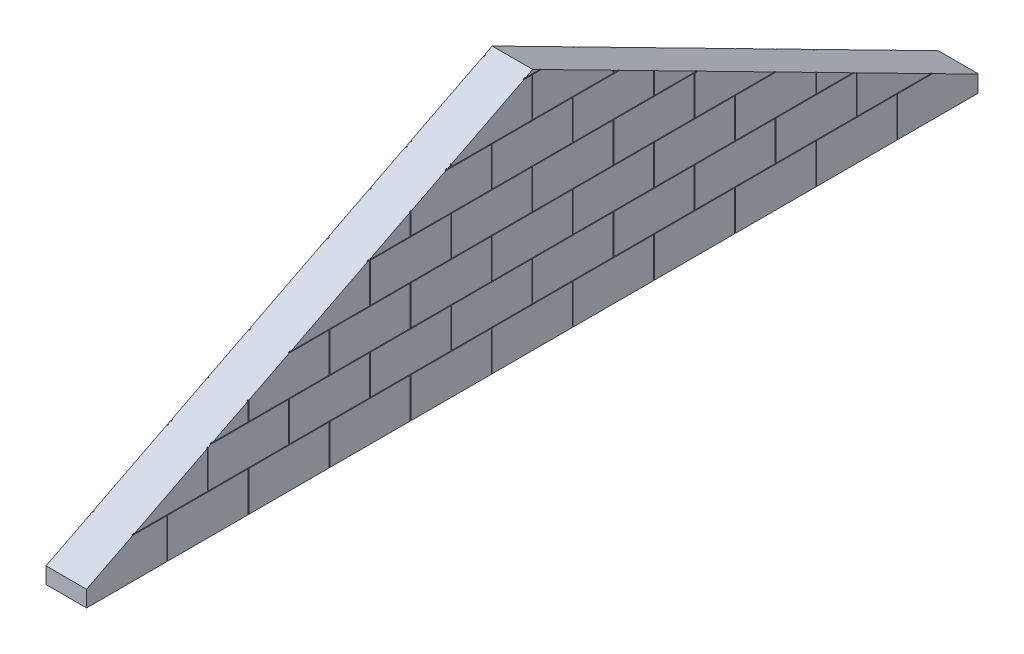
from build123d import *

# Parameters (mm, degrees)
EXTRUSION1_DEPTH                       = 25
ESQUISSE4_W                            = 650
ESQUISSE4_H                            = 0.5
ENL_V_MAT_EXTRU_2_DEPTH                = 0.5
ESQUISSE5_W                            = 0.5
ESQUISSE5_H                            = 24.5
ENL_V_MAT_EXTRU_3_DEPTH                = 0.5
R_P_TITION_LIN_AIRE3_COUNT             = 12
R_P_TITION_LIN_AIRE3_PITCH             = 50
R_P_TITION_LIN_AIRE4_COPY_1_SKETCH_W   = 0.5
R_P_TITION_LIN_AIRE4_COPY_1_SKETCH_H   = 24.5
R_P_TITION_LIN_AIRE4_COPY_1_DEPTH      = 0.5
R_P_TITION_LIN_AIRE4_COPY_2_SKETCH_W   = 0.5
R_P_TITION_LIN_AIRE4_COPY_2_SKETCH_H   = 24.5
R_P_TITION_LIN_AIRE4_COPY_2_DEPTH      = 0.5
R_P_TITION_LIN_AIRE4_COPY_3_SKETCH_W   = 0.5
R_P_TITION_LIN_AIRE4_COPY_3_SKETCH_H   = 24.5
R_P_TITION_LIN_AIRE4_COPY_3_DEPTH      = 0.5
R_P_TITION_LIN_AIRE4_COPY_4_SKETCH_W   = 0.5
R_P_TITION_LIN_AIRE4_COPY_4_SKETCH_H   = 24.5
R_P_TITION_LIN_AIRE4_COPY_4_DEPTH      = 0.5
R_P_TITION_LIN_AIRE4_COPY_5_SKETCH_W   = 0.5
R_P_TITION_LIN_AIRE4_COPY_5_SKETCH_H   = 24.5
R_P_TITION_LIN_AIRE4_COPY_5_DEPTH      = 0.5
R_P_TITION_LIN_AIRE4_COPY_6_SKETCH_W   = 0.5
R_P_TITION_LIN_AIRE4_COPY_6_SKETCH_H   = 24.5
R_P_TITION_LIN_AIRE4_COPY_6_DEPTH      = 0.5
R_P_TITION_LIN_AIRE4_COPY_7_SKETCH_W   = 0.5
R_P_TITION_LIN_AIRE4_COPY_7_SKETCH_H   = 24.5
R_P_TITION_LIN_AIRE4_COPY_7_DEPTH      = 0.5
R_P_TITION_LIN_AIRE4_COPY_8_SKETCH_W   = 0.5
R_P_TITION_LIN_AIRE4_COPY_8_SKETCH_H   = 24.5
R_P_TITION_LIN_AIRE4_COPY_8_DEPTH      = 0.5
R_P_TITION_LIN_AIRE4_COPY_9_SKETCH_W   = 0.5
R_P_TITION_LIN_AIRE4_COPY_9_SKETCH_H   = 24.5
R_P_TITION_LIN_AIRE4_COPY_9_DEPTH      = 0.5
R_P_TITION_LIN_AIRE4_COPY_10_SKETCH_W  = 0.5
R_P_TITION_LIN_AIRE4_COPY_10_SKETCH_H  = 24.5
R_P_TITION_LIN_AIRE4_COPY_10_DEPTH     = 0.5
R_P_TITION_LIN_AIRE4_COPY_11_SKETCH_W  = 0.5
R_P_TITION_LIN_AIRE4_COPY_11_SKETCH_H  = 24.5
R_P_TITION_LIN_AIRE4_COPY_11_DEPTH     = 0.5
R_P_TITION_LIN_AIRE4_COPY_12_SKETCH_W  = 0.5
R_P_TITION_LIN_AIRE4_COPY_12_SKETCH_H  = 24.5
R_P_TITION_LIN_AIRE4_COPY_12_DEPTH     = 0.5
R_P_TITION_LIN_AIRE4_COPY_13_SKETCH_W  = 0.5
R_P_TITION_LIN_AIRE4_COPY_13_SKETCH_H  = 24.5
R_P_TITION_LIN_AIRE4_COPY_13_DEPTH     = 0.5
R_P_TITION_LIN_AIRE4_COPY_14_SKETCH_W  = 0.5
R_P_TITION_LIN_AIRE4_COPY_14_SKETCH_H  = 24.5
R_P_TITION_LIN_AIRE4_COPY_14_DEPTH     = 0.5
R_P_TITION_LIN_AIRE4_COPY_15_SKETCH_W  = 0.5
R_P_TITION_LIN_AIRE4_COPY_15_SKETCH_H  = 24.5
R_P_TITION_LIN_AIRE4_COPY_15_DEPTH     = 0.5
R_P_TITION_LIN_AIRE4_COPY_16_SKETCH_W  = 0.5
R_P_TITION_LIN_AIRE4_COPY_16_SKETCH_H  = 24.5
R_P_TITION_LIN_AIRE4_COPY_16_DEPTH     = 0.5
R_P_TITION_LIN_AIRE4_COPY_17_SKETCH_W  = 0.5
R_P_TITION_LIN_AIRE4_COPY_17_SKETCH_H  = 24.5
R_P_TITION_LIN_AIRE4_COPY_17_DEPTH     = 0.5
R_P_TITION_LIN_AIRE4_COPY_18_SKETCH_W  = 0.5
R_P_TITION_LIN_AIRE4_COPY_18_SKETCH_H  = 24.5
R_P_TITION_LIN_AIRE4_COPY_18_DEPTH     = 0.5
R_P_TITION_LIN_AIRE4_COPY_19_SKETCH_W  = 0.5
R_P_TITION_LIN_AIRE4_COPY_19_SKETCH_H  = 24.5
R_P_TITION_LIN_AIRE4_COPY_19_DEPTH     = 0.5
R_P_TITION_LIN_AIRE4_COPY_20_SKETCH_W  = 0.5
R_P_TITION_LIN_AIRE4_COPY_20_SKETCH_H  = 24.5
R_P_TITION_LIN_AIRE4_COPY_20_DEPTH     = 0.5
R_P_TITION_LIN_AIRE4_COPY_21_SKETCH_W  = 0.5
R_P_TITION_LIN_AIRE4_COPY_21_SKETCH_H  = 24.5
R_P_TITION_LIN_AIRE4_COPY_21_DEPTH     = 0.5
R_P_TITION_LIN_AIRE4_COPY_22_SKETCH_W  = 0.5
R_P_TITION_LIN_AIRE4_COPY_22_SKETCH_H  = 24.5
R_P_TITION_LIN_AIRE4_COPY_22_DEPTH     = 0.5
R_P_TITION_LIN_AIRE4_COPY_23_SKETCH_W  = 0.5
R_P_TITION_LIN_AIRE4_COPY_23_SKETCH_H  = 24.5
R_P_TITION_LIN_AIRE4_COPY_23_DEPTH     = 0.5
R_P_TITION_LIN_AIRE4_COPY_24_SKETCH_W  = 0.5
R_P_TITION_LIN_AIRE4_COPY_24_SKETCH_H  = 24.5
R_P_TITION_LIN_AIRE4_COPY_24_DEPTH     = 0.5
R_P_TITION_LIN_AIRE4_COPY_25_SKETCH_W  = 0.5
R_P_TITION_LIN_AIRE4_COPY_25_SKETCH_H  = 24.5
R_P_TITION_LIN_AIRE4_COPY_25_DEPTH     = 0.5
R_P_TITION_LIN_AIRE4_COPY_26_SKETCH_W  = 0.5
R_P_TITION_LIN_AIRE4_COPY_26_SKETCH_H  = 24.5
R_P_TITION_LIN_AIRE4_COPY_26_DEPTH     = 0.5
R_P_TITION_LIN_AIRE4_COPY_27_SKETCH_W  = 0.5
R_P_TITION_LIN_AIRE4_COPY_27_SKETCH_H  = 24.5
R_P_TITION_LIN_AIRE4_COPY_27_DEPTH     = 0.5
R_P_TITION_LIN_AIRE4_COPY_28_SKETCH_W  = 0.5
R_P_TITION_LIN_AIRE4_COPY_28_SKETCH_H  = 24.5
R_P_TITION_LIN_AIRE4_COPY_28_DEPTH     = 0.5
R_P_TITION_LIN_AIRE4_COPY_29_SKETCH_W  = 0.5
R_P_TITION_LIN_AIRE4_COPY_29_SKETCH_H  = 24.5
R_P_TITION_LIN_AIRE4_COPY_29_DEPTH     = 0.5
R_P_TITION_LIN_AIRE4_COPY_30_SKETCH_W  = 0.5
R_P_TITION_LIN_AIRE4_COPY_30_SKETCH_H  = 24.5
R_P_TITION_LIN_AIRE4_COPY_30_DEPTH     = 0.5
R_P_TITION_LIN_AIRE4_COPY_31_SKETCH_W  = 0.5
R_P_TITION_LIN_AIRE4_COPY_31_SKETCH_H  = 24.5
R_P_TITION_LIN_AIRE4_COPY_31_DEPTH     = 0.5
R_P_TITION_LIN_AIRE4_COPY_32_SKETCH_W  = 0.5
R_P_TITION_LIN_AIRE4_COPY_32_SKETCH_H  = 24.5
R_P_TITION_LIN_AIRE4_COPY_32_DEPTH     = 0.5
R_P_TITION_LIN_AIRE4_COPY_33_SKETCH_W  = 0.5
R_P_TITION_LIN_AIRE4_COPY_33_SKETCH_H  = 24.5
R_P_TITION_LIN_AIRE4_COPY_33_DEPTH     = 0.5
R_P_TITION_LIN_AIRE4_COPY_34_SKETCH_W  = 0.5
R_P_TITION_LIN_AIRE4_COPY_34_SKETCH_H  = 24.5
R_P_TITION_LIN_AIRE4_COPY_34_DEPTH     = 0.5
R_P_TITION_LIN_AIRE4_COPY_35_SKETCH_W  = 0.5
R_P_TITION_LIN_AIRE4_COPY_35_SKETCH_H  = 24.5
R_P_TITION_LIN_AIRE4_COPY_35_DEPTH     = 0.5
R_P_TITION_LIN_AIRE4_COPY_36_SKETCH_W  = 0.5
R_P_TITION_LIN_AIRE4_COPY_36_SKETCH_H  = 24.5
R_P_TITION_LIN_AIRE4_COPY_36_DEPTH     = 0.5
R_P_TITION_LIN_AIRE4_COPY_37_SKETCH_W  = 0.5
R_P_TITION_LIN_AIRE4_COPY_37_SKETCH_H  = 24.5
R_P_TITION_LIN_AIRE4_COPY_37_DEPTH     = 0.5
R_P_TITION_LIN_AIRE4_COPY_38_SKETCH_W  = 0.5
R_P_TITION_LIN_AIRE4_COPY_38_SKETCH_H  = 24.5
R_P_TITION_LIN_AIRE4_COPY_38_DEPTH     = 0.5
R_P_TITION_LIN_AIRE4_COPY_39_SKETCH_W  = 0.5
R_P_TITION_LIN_AIRE4_COPY_39_SKETCH_H  = 24.5
R_P_TITION_LIN_AIRE4_COPY_39_DEPTH     = 0.5
R_P_TITION_LIN_AIRE4_COPY_40_SKETCH_W  = 0.5
R_P_TITION_LIN_AIRE4_COPY_40_SKETCH_H  = 24.5
R_P_TITION_LIN_AIRE4_COPY_40_DEPTH     = 0.5
R_P_TITION_LIN_AIRE4_COPY_41_SKETCH_W  = 0.5
R_P_TITION_LIN_AIRE4_COPY_41_SKETCH_H  = 24.5
R_P_TITION_LIN_AIRE4_COPY_41_DEPTH     = 0.5
R_P_TITION_LIN_AIRE4_COPY_42_SKETCH_W  = 0.5
R_P_TITION_LIN_AIRE4_COPY_42_SKETCH_H  = 24.5
R_P_TITION_LIN_AIRE4_COPY_42_DEPTH     = 0.5
R_P_TITION_LIN_AIRE4_COPY_43_SKETCH_W  = 0.5
R_P_TITION_LIN_AIRE4_COPY_43_SKETCH_H  = 24.5
R_P_TITION_LIN_AIRE4_COPY_43_DEPTH     = 0.5
R_P_TITION_LIN_AIRE4_COPY_44_SKETCH_W  = 0.5
R_P_TITION_LIN_AIRE4_COPY_44_SKETCH_H  = 24.5
R_P_TITION_LIN_AIRE4_COPY_44_DEPTH     = 0.5
R_P_TITION_LIN_AIRE4_COPY_45_SKETCH_W  = 0.5
R_P_TITION_LIN_AIRE4_COPY_45_SKETCH_H  = 24.5
R_P_TITION_LIN_AIRE4_COPY_45_DEPTH     = 0.5
R_P_TITION_LIN_AIRE4_COPY_46_SKETCH_W  = 0.5
R_P_TITION_LIN_AIRE4_COPY_46_SKETCH_H  = 24.5
R_P_TITION_LIN_AIRE4_COPY_46_DEPTH     = 0.5
R_P_TITION_LIN_AIRE4_COPY_47_SKETCH_W  = 0.5
R_P_TITION_LIN_AIRE4_COPY_47_SKETCH_H  = 24.5
R_P_TITION_LIN_AIRE4_COPY_47_DEPTH     = 0.5
R_P_TITION_LIN_AIRE4_COPY_48_SKETCH_W  = 0.5
R_P_TITION_LIN_AIRE4_COPY_48_SKETCH_H  = 24.5
R_P_TITION_LIN_AIRE4_COPY_48_DEPTH     = 0.5
SYM_TRIE4_COPY_1_SKETCH_W              = 0.5
SYM_TRIE4_COPY_1_SKETCH_H              = 24.5
SYM_TRIE4_COPY_1_DEPTH                 = 0.5
SYM_TRIE4_COPY_2_SKETCH_W              = 0.5
SYM_TRIE4_COPY_2_SKETCH_H              = 24.5
SYM_TRIE4_COPY_2_DEPTH                 = 0.5
SYM_TRIE4_COPY_3_SKETCH_W              = 0.5
SYM_TRIE4_COPY_3_SKETCH_H              = 24.5
SYM_TRIE4_COPY_3_DEPTH                 = 0.5
SYM_TRIE4_COPY_4_SKETCH_W              = 0.5
SYM_TRIE4_COPY_4_SKETCH_H              = 24.5
SYM_TRIE4_COPY_4_DEPTH                 = 0.5
SYM_TRIE4_COPY_5_SKETCH_W              = 0.5
SYM_TRIE4_COPY_5_SKETCH_H              = 24.5
SYM_TRIE4_COPY_5_DEPTH                 = 0.5
SYM_TRIE4_COPY_6_SKETCH_W              = 0.5
SYM_TRIE4_COPY_6_SKETCH_H              = 24.5
SYM_TRIE4_COPY_6_DEPTH                 = 0.5
SYM_TRIE4_COPY_7_SKETCH_W              = 0.5
SYM_TRIE4_COPY_7_SKETCH_H              = 24.5
SYM_TRIE4_COPY_7_DEPTH                 = 0.5
SYM_TRIE4_COPY_8_SKETCH_W              = 0.5
SYM_TRIE4_COPY_8_SKETCH_H              = 24.5
SYM_TRIE4_COPY_8_DEPTH                 = 0.5
SYM_TRIE4_COPY_9_SKETCH_W              = 0.5
SYM_TRIE4_COPY_9_SKETCH_H              = 24.5
SYM_TRIE4_COPY_9_DEPTH                 = 0.5
SYM_TRIE4_COPY_10_SKETCH_W             = 0.5
SYM_TRIE4_COPY_10_SKETCH_H             = 24.5
SYM_TRIE4_COPY_10_DEPTH                = 0.5
SYM_TRIE4_COPY_11_SKETCH_W             = 0.5
SYM_TRIE4_COPY_11_SKETCH_H             = 24.5
SYM_TRIE4_COPY_11_DEPTH                = 0.5
SYM_TRIE4_COPY_12_SKETCH_W             = 0.5
SYM_TRIE4_COPY_12_SKETCH_H             = 24.5
SYM_TRIE4_COPY_12_DEPTH                = 0.5
SYM_TRIE4_COPY_13_SKETCH_W             = 0.5
SYM_TRIE4_COPY_13_SKETCH_H             = 24.5
SYM_TRIE4_COPY_13_DEPTH                = 0.5
SYM_TRIE4_COPY_14_SKETCH_W             = 0.5
SYM_TRIE4_COPY_14_SKETCH_H             = 24.5
SYM_TRIE4_COPY_14_DEPTH                = 0.5
SYM_TRIE4_COPY_15_SKETCH_W             = 0.5
SYM_TRIE4_COPY_15_SKETCH_H             = 24.5
SYM_TRIE4_COPY_15_DEPTH                = 0.5
SYM_TRIE4_COPY_16_SKETCH_W             = 0.5
SYM_TRIE4_COPY_16_SKETCH_H             = 24.5
SYM_TRIE4_COPY_16_DEPTH                = 0.5
SYM_TRIE4_COPY_17_SKETCH_W             = 0.5
SYM_TRIE4_COPY_17_SKETCH_H             = 24.5
SYM_TRIE4_COPY_17_DEPTH                = 0.5
SYM_TRIE4_COPY_18_SKETCH_W             = 0.5
SYM_TRIE4_COPY_18_SKETCH_H             = 24.5
SYM_TRIE4_COPY_18_DEPTH                = 0.5
SYM_TRIE4_COPY_19_SKETCH_W             = 0.5
SYM_TRIE4_COPY_19_SKETCH_H             = 24.5
SYM_TRIE4_COPY_19_DEPTH                = 0.5
SYM_TRIE4_COPY_20_SKETCH_W             = 0.5
SYM_TRIE4_COPY_20_SKETCH_H             = 24.5
SYM_TRIE4_COPY_20_DEPTH                = 0.5
SYM_TRIE4_COPY_21_SKETCH_W             = 0.5
SYM_TRIE4_COPY_21_SKETCH_H             = 24.5
SYM_TRIE4_COPY_21_DEPTH                = 0.5
SYM_TRIE4_COPY_22_SKETCH_W             = 0.5
SYM_TRIE4_COPY_22_SKETCH_H             = 24.5
SYM_TRIE4_COPY_22_DEPTH                = 0.5
SYM_TRIE4_COPY_23_SKETCH_W             = 0.5
SYM_TRIE4_COPY_23_SKETCH_H             = 24.5
SYM_TRIE4_COPY_23_DEPTH                = 0.5
SYM_TRIE4_COPY_24_SKETCH_W             = 0.5
SYM_TRIE4_COPY_24_SKETCH_H             = 24.5
SYM_TRIE4_COPY_24_DEPTH                = 0.5
SYM_TRIE4_COPY_25_SKETCH_W             = 0.5
SYM_TRIE4_COPY_25_SKETCH_H             = 24.5
SYM_TRIE4_COPY_25_DEPTH                = 0.5
SYM_TRIE4_COPY_26_SKETCH_W             = 0.5
SYM_TRIE4_COPY_26_SKETCH_H             = 24.5
SYM_TRIE4_COPY_26_DEPTH                = 0.5
SYM_TRIE4_COPY_27_SKETCH_W             = 0.5
SYM_TRIE4_COPY_27_SKETCH_H             = 24.5
SYM_TRIE4_COPY_27_DEPTH                = 0.5
SYM_TRIE4_COPY_28_SKETCH_W             = 0.5
SYM_TRIE4_COPY_28_SKETCH_H             = 24.5
SYM_TRIE4_COPY_28_DEPTH                = 0.5
SYM_TRIE4_COPY_29_SKETCH_W             = 0.5
SYM_TRIE4_COPY_29_SKETCH_H             = 24.5
SYM_TRIE4_COPY_29_DEPTH                = 0.5
SYM_TRIE4_COPY_30_SKETCH_W             = 0.5
SYM_TRIE4_COPY_30_SKETCH_H             = 24.5
SYM_TRIE4_COPY_30_DEPTH                = 0.5
SYM_TRIE4_COPY_31_SKETCH_W             = 0.5
SYM_TRIE4_COPY_31_SKETCH_H             = 24.5
SYM_TRIE4_COPY_31_DEPTH                = 0.5
SYM_TRIE4_COPY_32_SKETCH_W             = 0.5
SYM_TRIE4_COPY_32_SKETCH_H             = 24.5
SYM_TRIE4_COPY_32_DEPTH                = 0.5
SYM_TRIE4_COPY_33_SKETCH_W             = 0.5
SYM_TRIE4_COPY_33_SKETCH_H             = 24.5
SYM_TRIE4_COPY_33_DEPTH                = 0.5
SYM_TRIE4_COPY_34_SKETCH_W             = 0.5
SYM_TRIE4_COPY_34_SKETCH_H             = 24.5
SYM_TRIE4_COPY_34_DEPTH                = 0.5
SYM_TRIE4_COPY_35_SKETCH_W             = 0.5
SYM_TRIE4_COPY_35_SKETCH_H             = 24.5
SYM_TRIE4_COPY_35_DEPTH                = 0.5
SYM_TRIE4_COPY_36_SKETCH_W             = 0.5
SYM_TRIE4_COPY_36_SKETCH_H             = 24.5
SYM_TRIE4_COPY_36_DEPTH                = 0.5
SYM_TRIE4_COPY_37_SKETCH_W             = 0.5
SYM_TRIE4_COPY_37_SKETCH_H             = 24.5
SYM_TRIE4_COPY_37_DEPTH                = 0.5
SYM_TRIE4_COPY_38_SKETCH_W             = 0.5
SYM_TRIE4_COPY_38_SKETCH_H             = 24.5
SYM_TRIE4_COPY_38_DEPTH                = 0.5
SYM_TRIE4_COPY_39_SKETCH_W             = 0.5
SYM_TRIE4_COPY_39_SKETCH_H             = 24.5
SYM_TRIE4_COPY_39_DEPTH                = 0.5
SYM_TRIE4_COPY_40_SKETCH_W             = 0.5
SYM_TRIE4_COPY_40_SKETCH_H             = 24.5
SYM_TRIE4_COPY_40_DEPTH                = 0.5
SYM_TRIE4_COPY_41_SKETCH_W             = 0.5
SYM_TRIE4_COPY_41_SKETCH_H             = 24.5
SYM_TRIE4_COPY_41_DEPTH                = 0.5
SYM_TRIE4_COPY_42_SKETCH_W             = 0.5
SYM_TRIE4_COPY_42_SKETCH_H             = 24.5
SYM_TRIE4_COPY_42_DEPTH                = 0.5
SYM_TRIE4_COPY_43_SKETCH_W             = 0.5
SYM_TRIE4_COPY_43_SKETCH_H             = 24.5
SYM_TRIE4_COPY_43_DEPTH                = 0.5
SYM_TRIE4_COPY_44_SKETCH_W             = 0.5
SYM_TRIE4_COPY_44_SKETCH_H             = 24.5
SYM_TRIE4_COPY_44_DEPTH                = 0.5
SYM_TRIE4_COPY_45_SKETCH_W             = 0.5
SYM_TRIE4_COPY_45_SKETCH_H             = 24.5
SYM_TRIE4_COPY_45_DEPTH                = 0.5
SYM_TRIE4_COPY_46_SKETCH_W             = 0.5
SYM_TRIE4_COPY_46_SKETCH_H             = 24.5
SYM_TRIE4_COPY_46_DEPTH                = 0.5
SYM_TRIE4_COPY_47_SKETCH_W             = 0.5
SYM_TRIE4_COPY_47_SKETCH_H             = 24.5
SYM_TRIE4_COPY_47_DEPTH                = 0.5
SYM_TRIE4_COPY_48_SKETCH_W             = 0.5
SYM_TRIE4_COPY_48_SKETCH_H             = 24.5
SYM_TRIE4_COPY_48_DEPTH                = 0.5
SYM_TRIE4_COPY_49_SKETCH_W             = 0.5
SYM_TRIE4_COPY_49_SKETCH_H             = 24.5
SYM_TRIE4_COPY_49_DEPTH                = 0.5
SYM_TRIE4_COPY_50_SKETCH_W             = 0.5
SYM_TRIE4_COPY_50_SKETCH_H             = 24.5
SYM_TRIE4_COPY_50_DEPTH                = 0.5
SYM_TRIE4_COPY_51_SKETCH_W             = 0.5
SYM_TRIE4_COPY_51_SKETCH_H             = 24.5
SYM_TRIE4_COPY_51_DEPTH                = 0.5
SYM_TRIE4_COPY_52_SKETCH_W             = 0.5
SYM_TRIE4_COPY_52_SKETCH_H             = 24.5
SYM_TRIE4_COPY_52_DEPTH                = 0.5
SYM_TRIE4_COPY_53_SKETCH_W             = 0.5
SYM_TRIE4_COPY_53_SKETCH_H             = 24.5
SYM_TRIE4_COPY_53_DEPTH                = 0.5
SYM_TRIE4_COPY_54_SKETCH_W             = 0.5
SYM_TRIE4_COPY_54_SKETCH_H             = 24.5
SYM_TRIE4_COPY_54_DEPTH                = 0.5
SYM_TRIE4_COPY_55_SKETCH_W             = 0.5
SYM_TRIE4_COPY_55_SKETCH_H             = 24.5
SYM_TRIE4_COPY_55_DEPTH                = 0.5
SYM_TRIE4_COPY_56_SKETCH_W             = 0.5
SYM_TRIE4_COPY_56_SKETCH_H             = 24.5
SYM_TRIE4_COPY_56_DEPTH                = 0.5
SYM_TRIE4_COPY_57_SKETCH_W             = 0.5
SYM_TRIE4_COPY_57_SKETCH_H             = 24.5
SYM_TRIE4_COPY_57_DEPTH                = 0.5
SYM_TRIE4_COPY_58_SKETCH_W             = 0.5
SYM_TRIE4_COPY_58_SKETCH_H             = 24.5
SYM_TRIE4_COPY_58_DEPTH                = 0.5
SYM_TRIE4_COPY_59_SKETCH_W             = 0.5
SYM_TRIE4_COPY_59_SKETCH_H             = 24.5
SYM_TRIE4_COPY_59_DEPTH                = 0.5
SYM_TRIE4_COPY_60_SKETCH_W             = 0.5
SYM_TRIE4_COPY_60_SKETCH_H             = 24.5
SYM_TRIE4_COPY_60_DEPTH                = 0.5
SYM_TRIE4_COPY_61_SKETCH_W             = 0.5
SYM_TRIE4_COPY_61_SKETCH_H             = 24.5
SYM_TRIE4_COPY_61_DEPTH                = 0.5
ESQUISSE7_W                            = 0.5
ESQUISSE7_H                            = 24
ENL_V_MAT_EXTRU_4_DEPTH                = 0.5
R_P_TITION_LIN_AIRE5_COUNT             = 11
R_P_TITION_LIN_AIRE5_PITCH             = 50
R_P_TITION_LIN_AIRE8_COPY_1_SKETCH_W   = 0.5
R_P_TITION_LIN_AIRE8_COPY_1_SKETCH_H   = 24
R_P_TITION_LIN_AIRE8_COPY_1_DEPTH      = 0.5
R_P_TITION_LIN_AIRE8_COPY_2_SKETCH_W   = 0.5
R_P_TITION_LIN_AIRE8_COPY_2_SKETCH_H   = 24
R_P_TITION_LIN_AIRE8_COPY_2_DEPTH      = 0.5
R_P_TITION_LIN_AIRE8_COPY_3_SKETCH_W   = 0.5
R_P_TITION_LIN_AIRE8_COPY_3_SKETCH_H   = 24
R_P_TITION_LIN_AIRE8_COPY_3_DEPTH      = 0.5
R_P_TITION_LIN_AIRE8_COPY_4_SKETCH_W   = 0.5
R_P_TITION_LIN_AIRE8_COPY_4_SKETCH_H   = 24
R_P_TITION_LIN_AIRE8_COPY_4_DEPTH      = 0.5
R_P_TITION_LIN_AIRE8_COPY_5_SKETCH_W   = 0.5
R_P_TITION_LIN_AIRE8_COPY_5_SKETCH_H   = 24
R_P_TITION_LIN_AIRE8_COPY_5_DEPTH      = 0.5
R_P_TITION_LIN_AIRE8_COPY_6_SKETCH_W   = 0.5
R_P_TITION_LIN_AIRE8_COPY_6_SKETCH_H   = 24
R_P_TITION_LIN_AIRE8_COPY_6_DEPTH      = 0.5
R_P_TITION_LIN_AIRE8_COPY_7_SKETCH_W   = 0.5
R_P_TITION_LIN_AIRE8_COPY_7_SKETCH_H   = 24
R_P_TITION_LIN_AIRE8_COPY_7_DEPTH      = 0.5
R_P_TITION_LIN_AIRE8_COPY_8_SKETCH_W   = 0.5
R_P_TITION_LIN_AIRE8_COPY_8_SKETCH_H   = 24
R_P_TITION_LIN_AIRE8_COPY_8_DEPTH      = 0.5
R_P_TITION_LIN_AIRE8_COPY_9_SKETCH_W   = 0.5
R_P_TITION_LIN_AIRE8_COPY_9_SKETCH_H   = 24
R_P_TITION_LIN_AIRE8_COPY_9_DEPTH      = 0.5
R_P_TITION_LIN_AIRE8_COPY_10_SKETCH_W  = 0.5
R_P_TITION_LIN_AIRE8_COPY_10_SKETCH_H  = 24
R_P_TITION_LIN_AIRE8_COPY_10_DEPTH     = 0.5
R_P_TITION_LIN_AIRE8_COPY_11_SKETCH_W  = 0.5
R_P_TITION_LIN_AIRE8_COPY_11_SKETCH_H  = 24
R_P_TITION_LIN_AIRE8_COPY_11_DEPTH     = 0.5
R_P_TITION_LIN_AIRE8_COPY_12_SKETCH_W  = 0.5
R_P_TITION_LIN_AIRE8_COPY_12_SKETCH_H  = 24
R_P_TITION_LIN_AIRE8_COPY_12_DEPTH     = 0.5
R_P_TITION_LIN_AIRE8_COPY_13_SKETCH_W  = 0.5
R_P_TITION_LIN_AIRE8_COPY_13_SKETCH_H  = 24
R_P_TITION_LIN_AIRE8_COPY_13_DEPTH     = 0.5
R_P_TITION_LIN_AIRE8_COPY_14_SKETCH_W  = 0.5
R_P_TITION_LIN_AIRE8_COPY_14_SKETCH_H  = 24
R_P_TITION_LIN_AIRE8_COPY_14_DEPTH     = 0.5
R_P_TITION_LIN_AIRE8_COPY_15_SKETCH_W  = 0.5
R_P_TITION_LIN_AIRE8_COPY_15_SKETCH_H  = 24
R_P_TITION_LIN_AIRE8_COPY_15_DEPTH     = 0.5
R_P_TITION_LIN_AIRE8_COPY_16_SKETCH_W  = 0.5
R_P_TITION_LIN_AIRE8_COPY_16_SKETCH_H  = 24
R_P_TITION_LIN_AIRE8_COPY_16_DEPTH     = 0.5
R_P_TITION_LIN_AIRE8_COPY_17_SKETCH_W  = 0.5
R_P_TITION_LIN_AIRE8_COPY_17_SKETCH_H  = 24
R_P_TITION_LIN_AIRE8_COPY_17_DEPTH     = 0.5
R_P_TITION_LIN_AIRE8_COPY_18_SKETCH_W  = 0.5
R_P_TITION_LIN_AIRE8_COPY_18_SKETCH_H  = 24
R_P_TITION_LIN_AIRE8_COPY_18_DEPTH     = 0.5
R_P_TITION_LIN_AIRE9_COUNT             = 6
R_P_TITION_LIN_AIRE9_PITCH             = 24.55
R_P_TITION_LIN_AIRE10_COPY_1_SKETCH_W  = 0.5
R_P_TITION_LIN_AIRE10_COPY_1_SKETCH_H  = 24
R_P_TITION_LIN_AIRE10_COPY_1_DEPTH     = 0.5
R_P_TITION_LIN_AIRE10_COPY_2_SKETCH_W  = 0.5
R_P_TITION_LIN_AIRE10_COPY_2_SKETCH_H  = 24
R_P_TITION_LIN_AIRE10_COPY_2_DEPTH     = 0.5
R_P_TITION_LIN_AIRE10_COPY_3_SKETCH_W  = 0.5
R_P_TITION_LIN_AIRE10_COPY_3_SKETCH_H  = 24
R_P_TITION_LIN_AIRE10_COPY_3_DEPTH     = 0.5
R_P_TITION_LIN_AIRE10_COPY_4_SKETCH_W  = 0.5
R_P_TITION_LIN_AIRE10_COPY_4_SKETCH_H  = 24
R_P_TITION_LIN_AIRE10_COPY_4_DEPTH     = 0.5
R_P_TITION_LIN_AIRE10_COPY_5_SKETCH_W  = 0.5
R_P_TITION_LIN_AIRE10_COPY_5_SKETCH_H  = 24
R_P_TITION_LIN_AIRE10_COPY_5_DEPTH     = 0.5
R_P_TITION_LIN_AIRE10_COPY_6_SKETCH_W  = 0.5
R_P_TITION_LIN_AIRE10_COPY_6_SKETCH_H  = 24
R_P_TITION_LIN_AIRE10_COPY_6_DEPTH     = 0.5
R_P_TITION_LIN_AIRE10_COPY_7_SKETCH_W  = 0.5
R_P_TITION_LIN_AIRE10_COPY_7_SKETCH_H  = 24
R_P_TITION_LIN_AIRE10_COPY_7_DEPTH     = 0.5
R_P_TITION_LIN_AIRE10_COPY_8_SKETCH_W  = 0.5
R_P_TITION_LIN_AIRE10_COPY_8_SKETCH_H  = 24
R_P_TITION_LIN_AIRE10_COPY_8_DEPTH     = 0.5
R_P_TITION_LIN_AIRE10_COPY_9_SKETCH_W  = 0.5
R_P_TITION_LIN_AIRE10_COPY_9_SKETCH_H  = 24
R_P_TITION_LIN_AIRE10_COPY_9_DEPTH     = 0.5
R_P_TITION_LIN_AIRE10_COPY_10_SKETCH_W = 0.5
R_P_TITION_LIN_AIRE10_COPY_10_SKETCH_H = 24
R_P_TITION_LIN_AIRE10_COPY_10_DEPTH    = 0.5
R_P_TITION_LIN_AIRE10_COPY_11_SKETCH_W = 0.5
R_P_TITION_LIN_AIRE10_COPY_11_SKETCH_H = 24
R_P_TITION_LIN_AIRE10_COPY_11_DEPTH    = 0.5
R_P_TITION_LIN_AIRE10_COPY_12_SKETCH_W = 0.5
R_P_TITION_LIN_AIRE10_COPY_12_SKETCH_H = 24
R_P_TITION_LIN_AIRE10_COPY_12_DEPTH    = 0.5
R_P_TITION_LIN_AIRE10_COPY_13_SKETCH_W = 0.5
R_P_TITION_LIN_AIRE10_COPY_13_SKETCH_H = 24
R_P_TITION_LIN_AIRE10_COPY_13_DEPTH    = 0.5
R_P_TITION_LIN_AIRE10_COPY_14_SKETCH_W = 0.5
R_P_TITION_LIN_AIRE10_COPY_14_SKETCH_H = 24
R_P_TITION_LIN_AIRE10_COPY_14_DEPTH    = 0.5
R_P_TITION_LIN_AIRE10_COPY_15_SKETCH_W = 0.5
R_P_TITION_LIN_AIRE10_COPY_15_SKETCH_H = 24
R_P_TITION_LIN_AIRE10_COPY_15_DEPTH    = 0.5
R_P_TITION_LIN_AIRE10_COPY_16_SKETCH_W = 0.5
R_P_TITION_LIN_AIRE10_COPY_16_SKETCH_H = 24
R_P_TITION_LIN_AIRE10_COPY_16_DEPTH    = 0.5
R_P_TITION_LIN_AIRE10_COPY_17_SKETCH_W = 0.5
R_P_TITION_LIN_AIRE10_COPY_17_SKETCH_H = 24
R_P_TITION_LIN_AIRE10_COPY_17_DEPTH    = 0.5
R_P_TITION_LIN_AIRE10_COPY_18_SKETCH_W = 0.5
R_P_TITION_LIN_AIRE10_COPY_18_SKETCH_H = 24
R_P_TITION_LIN_AIRE10_COPY_18_DEPTH    = 0.5
R_P_TITION_LIN_AIRE10_COPY_19_SKETCH_W = 0.5
R_P_TITION_LIN_AIRE10_COPY_19_SKETCH_H = 24
R_P_TITION_LIN_AIRE10_COPY_19_DEPTH    = 0.5
R_P_TITION_LIN_AIRE10_COPY_20_SKETCH_W = 0.5
R_P_TITION_LIN_AIRE10_COPY_20_SKETCH_H = 24
R_P_TITION_LIN_AIRE10_COPY_20_DEPTH    = 0.5
R_P_TITION_LIN_AIRE10_COPY_21_SKETCH_W = 0.5
R_P_TITION_LIN_AIRE10_COPY_21_SKETCH_H = 24
R_P_TITION_LIN_AIRE10_COPY_21_DEPTH    = 0.5
R_P_TITION_LIN_AIRE10_COPY_22_SKETCH_W = 0.5
R_P_TITION_LIN_AIRE10_COPY_22_SKETCH_H = 24
R_P_TITION_LIN_AIRE10_COPY_22_DEPTH    = 0.5
R_P_TITION_LIN_AIRE10_COPY_23_SKETCH_W = 0.5
R_P_TITION_LIN_AIRE10_COPY_23_SKETCH_H = 24
R_P_TITION_LIN_AIRE10_COPY_23_DEPTH    = 0.5
R_P_TITION_LIN_AIRE10_COPY_24_SKETCH_W = 0.5
R_P_TITION_LIN_AIRE10_COPY_24_SKETCH_H = 24
R_P_TITION_LIN_AIRE10_COPY_24_DEPTH    = 0.5
R_P_TITION_LIN_AIRE10_COPY_25_SKETCH_W = 0.5
R_P_TITION_LIN_AIRE10_COPY_25_SKETCH_H = 24
R_P_TITION_LIN_AIRE10_COPY_25_DEPTH    = 0.5
R_P_TITION_LIN_AIRE10_COPY_26_SKETCH_W = 0.5
R_P_TITION_LIN_AIRE10_COPY_26_SKETCH_H = 24
R_P_TITION_LIN_AIRE10_COPY_26_DEPTH    = 0.5
R_P_TITION_LIN_AIRE10_COPY_27_SKETCH_W = 0.5
R_P_TITION_LIN_AIRE10_COPY_27_SKETCH_H = 24
R_P_TITION_LIN_AIRE10_COPY_27_DEPTH    = 0.5
R_P_TITION_LIN_AIRE10_COPY_28_SKETCH_W = 0.5
R_P_TITION_LIN_AIRE10_COPY_28_SKETCH_H = 24
R_P_TITION_LIN_AIRE10_COPY_28_DEPTH    = 0.5
R_P_TITION_LIN_AIRE10_COPY_29_SKETCH_W = 0.5
R_P_TITION_LIN_AIRE10_COPY_29_SKETCH_H = 24
R_P_TITION_LIN_AIRE10_COPY_29_DEPTH    = 0.5
R_P_TITION_LIN_AIRE10_COPY_30_SKETCH_W = 0.5
R_P_TITION_LIN_AIRE10_COPY_30_SKETCH_H = 24
R_P_TITION_LIN_AIRE10_COPY_30_DEPTH    = 0.5
R_P_TITION_LIN_AIRE10_COPY_31_SKETCH_W = 0.5
R_P_TITION_LIN_AIRE10_COPY_31_SKETCH_H = 24
R_P_TITION_LIN_AIRE10_COPY_31_DEPTH    = 0.5
R_P_TITION_LIN_AIRE10_COPY_32_SKETCH_W = 0.5
R_P_TITION_LIN_AIRE10_COPY_32_SKETCH_H = 24
R_P_TITION_LIN_AIRE10_COPY_32_DEPTH    = 0.5
R_P_TITION_LIN_AIRE10_COPY_33_SKETCH_W = 0.5
R_P_TITION_LIN_AIRE10_COPY_33_SKETCH_H = 24
R_P_TITION_LIN_AIRE10_COPY_33_DEPTH    = 0.5
R_P_TITION_LIN_AIRE10_COPY_34_SKETCH_W = 0.5
R_P_TITION_LIN_AIRE10_COPY_34_SKETCH_H = 24
R_P_TITION_LIN_AIRE10_COPY_34_DEPTH    = 0.5
R_P_TITION_LIN_AIRE10_COPY_35_SKETCH_W = 0.5
R_P_TITION_LIN_AIRE10_COPY_35_SKETCH_H = 24
R_P_TITION_LIN_AIRE10_COPY_35_DEPTH    = 0.5
R_P_TITION_LIN_AIRE10_COPY_36_SKETCH_W = 0.5
R_P_TITION_LIN_AIRE10_COPY_36_SKETCH_H = 24
R_P_TITION_LIN_AIRE10_COPY_36_DEPTH    = 0.5
R_P_TITION_LIN_AIRE10_COPY_37_SKETCH_W = 0.5
R_P_TITION_LIN_AIRE10_COPY_37_SKETCH_H = 24
R_P_TITION_LIN_AIRE10_COPY_37_DEPTH    = 0.5
R_P_TITION_LIN_AIRE10_COPY_38_SKETCH_W = 0.5
R_P_TITION_LIN_AIRE10_COPY_38_SKETCH_H = 24
R_P_TITION_LIN_AIRE10_COPY_38_DEPTH    = 0.5
SYM_TRIE9_COPY_1_SKETCH_W              = 650
SYM_TRIE9_COPY_1_SKETCH_H              = 0.5
SYM_TRIE9_COPY_1_DEPTH                 = 0.5
SYM_TRIE9_COPY_2_SKETCH_W              = 650
SYM_TRIE9_COPY_2_SKETCH_H              = 0.5
SYM_TRIE9_COPY_2_DEPTH                 = 0.5
SYM_TRIE9_COPY_3_SKETCH_W              = 650
SYM_TRIE9_COPY_3_SKETCH_H              = 0.5
SYM_TRIE9_COPY_3_DEPTH                 = 0.5
SYM_TRIE9_COPY_4_SKETCH_W              = 650
SYM_TRIE9_COPY_4_SKETCH_H              = 0.5
SYM_TRIE9_COPY_4_DEPTH                 = 0.5
SYM_TRIE9_COPY_5_SKETCH_W              = 650
SYM_TRIE9_COPY_5_SKETCH_H              = 0.5
SYM_TRIE9_COPY_5_DEPTH                 = 0.5
SYM_TRIE9_COPY_6_SKETCH_W              = 650
SYM_TRIE9_COPY_6_SKETCH_H              = 0.5
SYM_TRIE9_COPY_6_DEPTH                 = 0.5


with BuildPart() as part:
    # Esquisse1 → Extrusion1 (new body)
    with BuildSketch(Plane(origin=(0, 0, 0), x_dir=(0, 0, -1), z_dir=(1, 0, 0))):
        Polygon((0, 0), (550, 0), (550, 10.003538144), (275, 150), (0, 10), align=None)
    extrude(amount=EXTRUSION1_DEPTH)

    # Esquisse4 → Enl_v. mat.-Extru.2 (cut)
    with BuildSketch(Plane(origin=(25, 0, 0), x_dir=(0, 0, -1), z_dir=(1, 0, 0))):
        with Locations((325, 24.75)):
            Rectangle(ESQUISSE4_W, ESQUISSE4_H)
    enl_v_mat_extru_2 = extrude(amount=-ENL_V_MAT_EXTRU_2_DEPTH, mode=Mode.SUBTRACT)

    # Sym_trie1: Enl_v. mat.-Extru.2 across plane
    add(enl_v_mat_extru_2.mirror(Plane(origin=(12.5, 0, 0), x_dir=(0, 0, 1), z_dir=(1, 0, 0))), mode=Mode.SUBTRACT)

    # Esquisse5 → Enl_v. mat.-Extru.3 (cut)
    with BuildSketch(Plane(origin=(25, 0, 0), x_dir=(0, 0, -1), z_dir=(1, 0, 0))):
        with Locations((49.75, 12.25)):
            Rectangle(ESQUISSE5_W, ESQUISSE5_H)
    enl_v_mat_extru_3 = extrude(amount=-ENL_V_MAT_EXTRU_3_DEPTH, mode=Mode.SUBTRACT)

    # R_p_tition lin_aire3: Enl_v. mat.-Extru.3 ×12
    with Locations(*[(0, 0, -i * R_P_TITION_LIN_AIRE3_PITCH) for i in range(1, R_P_TITION_LIN_AIRE3_COUNT)]):
        add(enl_v_mat_extru_3, mode=Mode.SUBTRACT)

    # Sym_trie3: Enl_v. mat.-Extru.3 across plane
    add(enl_v_mat_extru_3.mirror(Plane(origin=(12.5, 0, 0), x_dir=(0, 0, 1), z_dir=(1, 0, 0))), mode=Mode.SUBTRACT)

    # R_p_tition lin_aire4 copy 1 sketch → R_p_tition lin_aire4 copy 1 (cut)
    with BuildSketch(Plane(origin=(25, 49, -50), x_dir=(0, 0, -1), z_dir=(1, 0, 0))):
        with Locations((49.75, 12.25)):
            Rectangle(R_P_TITION_LIN_AIRE4_COPY_1_SKETCH_W, R_P_TITION_LIN_AIRE4_COPY_1_SKETCH_H)
    extrude(amount=-R_P_TITION_LIN_AIRE4_COPY_1_DEPTH, mode=Mode.SUBTRACT)

    # R_p_tition lin_aire4 copy 2 sketch → R_p_tition lin_aire4 copy 2 (cut)
    with BuildSketch(Plane(origin=(25, 98, -50), x_dir=(0, 0, -1), z_dir=(1, 0, 0))):
        with Locations((49.75, 12.25)):
            Rectangle(R_P_TITION_LIN_AIRE4_COPY_2_SKETCH_W, R_P_TITION_LIN_AIRE4_COPY_2_SKETCH_H)
    extrude(amount=-R_P_TITION_LIN_AIRE4_COPY_2_DEPTH, mode=Mode.SUBTRACT)

    # R_p_tition lin_aire4 copy 3 sketch → R_p_tition lin_aire4 copy 3 (cut)
    with BuildSketch(Plane(origin=(25, 147, -50), x_dir=(0, 0, -1), z_dir=(1, 0, 0))):
        with Locations((49.75, 12.25)):
            Rectangle(R_P_TITION_LIN_AIRE4_COPY_3_SKETCH_W, R_P_TITION_LIN_AIRE4_COPY_3_SKETCH_H)
    extrude(amount=-R_P_TITION_LIN_AIRE4_COPY_3_DEPTH, mode=Mode.SUBTRACT)

    # R_p_tition lin_aire4 copy 4 sketch → R_p_tition lin_aire4 copy 4 (cut)
    with BuildSketch(Plane(origin=(25, 196, -50), x_dir=(0, 0, -1), z_dir=(1, 0, 0))):
        with Locations((49.75, 12.25)):
            Rectangle(R_P_TITION_LIN_AIRE4_COPY_4_SKETCH_W, R_P_TITION_LIN_AIRE4_COPY_4_SKETCH_H)
    extrude(amount=-R_P_TITION_LIN_AIRE4_COPY_4_DEPTH, mode=Mode.SUBTRACT)

    # R_p_tition lin_aire4 copy 5 sketch → R_p_tition lin_aire4 copy 5 (cut)
    with BuildSketch(Plane(origin=(25, 49, -100), x_dir=(0, 0, -1), z_dir=(1, 0, 0))):
        with Locations((49.75, 12.25)):
            Rectangle(R_P_TITION_LIN_AIRE4_COPY_5_SKETCH_W, R_P_TITION_LIN_AIRE4_COPY_5_SKETCH_H)
    extrude(amount=-R_P_TITION_LIN_AIRE4_COPY_5_DEPTH, mode=Mode.SUBTRACT)

    # R_p_tition lin_aire4 copy 6 sketch → R_p_tition lin_aire4 copy 6 (cut)
    with BuildSketch(Plane(origin=(25, 98, -100), x_dir=(0, 0, -1), z_dir=(1, 0, 0))):
        with Locations((49.75, 12.25)):
            Rectangle(R_P_TITION_LIN_AIRE4_COPY_6_SKETCH_W, R_P_TITION_LIN_AIRE4_COPY_6_SKETCH_H)
    extrude(amount=-R_P_TITION_LIN_AIRE4_COPY_6_DEPTH, mode=Mode.SUBTRACT)

    # R_p_tition lin_aire4 copy 7 sketch → R_p_tition lin_aire4 copy 7 (cut)
    with BuildSketch(Plane(origin=(25, 147, -100), x_dir=(0, 0, -1), z_dir=(1, 0, 0))):
        with Locations((49.75, 12.25)):
            Rectangle(R_P_TITION_LIN_AIRE4_COPY_7_SKETCH_W, R_P_TITION_LIN_AIRE4_COPY_7_SKETCH_H)
    extrude(amount=-R_P_TITION_LIN_AIRE4_COPY_7_DEPTH, mode=Mode.SUBTRACT)

    # R_p_tition lin_aire4 copy 8 sketch → R_p_tition lin_aire4 copy 8 (cut)
    with BuildSketch(Plane(origin=(25, 196, -100), x_dir=(0, 0, -1), z_dir=(1, 0, 0))):
        with Locations((49.75, 12.25)):
            Rectangle(R_P_TITION_LIN_AIRE4_COPY_8_SKETCH_W, R_P_TITION_LIN_AIRE4_COPY_8_SKETCH_H)
    extrude(amount=-R_P_TITION_LIN_AIRE4_COPY_8_DEPTH, mode=Mode.SUBTRACT)

    # R_p_tition lin_aire4 copy 9 sketch → R_p_tition lin_aire4 copy 9 (cut)
    with BuildSketch(Plane(origin=(25, 49, -150), x_dir=(0, 0, -1), z_dir=(1, 0, 0))):
        with Locations((49.75, 12.25)):
            Rectangle(R_P_TITION_LIN_AIRE4_COPY_9_SKETCH_W, R_P_TITION_LIN_AIRE4_COPY_9_SKETCH_H)
    extrude(amount=-R_P_TITION_LIN_AIRE4_COPY_9_DEPTH, mode=Mode.SUBTRACT)

    # R_p_tition lin_aire4 copy 10 sketch → R_p_tition lin_aire4 copy 10 (cut)
    with BuildSketch(Plane(origin=(25, 98, -150), x_dir=(0, 0, -1), z_dir=(1, 0, 0))):
        with Locations((49.75, 12.25)):
            Rectangle(R_P_TITION_LIN_AIRE4_COPY_10_SKETCH_W, R_P_TITION_LIN_AIRE4_COPY_10_SKETCH_H)
    extrude(amount=-R_P_TITION_LIN_AIRE4_COPY_10_DEPTH, mode=Mode.SUBTRACT)

    # R_p_tition lin_aire4 copy 11 sketch → R_p_tition lin_aire4 copy 11 (cut)
    with BuildSketch(Plane(origin=(25, 147, -150), x_dir=(0, 0, -1), z_dir=(1, 0, 0))):
        with Locations((49.75, 12.25)):
            Rectangle(R_P_TITION_LIN_AIRE4_COPY_11_SKETCH_W, R_P_TITION_LIN_AIRE4_COPY_11_SKETCH_H)
    extrude(amount=-R_P_TITION_LIN_AIRE4_COPY_11_DEPTH, mode=Mode.SUBTRACT)

    # R_p_tition lin_aire4 copy 12 sketch → R_p_tition lin_aire4 copy 12 (cut)
    with BuildSketch(Plane(origin=(25, 196, -150), x_dir=(0, 0, -1), z_dir=(1, 0, 0))):
        with Locations((49.75, 12.25)):
            Rectangle(R_P_TITION_LIN_AIRE4_COPY_12_SKETCH_W, R_P_TITION_LIN_AIRE4_COPY_12_SKETCH_H)
    extrude(amount=-R_P_TITION_LIN_AIRE4_COPY_12_DEPTH, mode=Mode.SUBTRACT)

    # R_p_tition lin_aire4 copy 13 sketch → R_p_tition lin_aire4 copy 13 (cut)
    with BuildSketch(Plane(origin=(25, 49, -200), x_dir=(0, 0, -1), z_dir=(1, 0, 0))):
        with Locations((49.75, 12.25)):
            Rectangle(R_P_TITION_LIN_AIRE4_COPY_13_SKETCH_W, R_P_TITION_LIN_AIRE4_COPY_13_SKETCH_H)
    extrude(amount=-R_P_TITION_LIN_AIRE4_COPY_13_DEPTH, mode=Mode.SUBTRACT)

    # R_p_tition lin_aire4 copy 14 sketch → R_p_tition lin_aire4 copy 14 (cut)
    with BuildSketch(Plane(origin=(25, 98, -200), x_dir=(0, 0, -1), z_dir=(1, 0, 0))):
        with Locations((49.75, 12.25)):
            Rectangle(R_P_TITION_LIN_AIRE4_COPY_14_SKETCH_W, R_P_TITION_LIN_AIRE4_COPY_14_SKETCH_H)
    extrude(amount=-R_P_TITION_LIN_AIRE4_COPY_14_DEPTH, mode=Mode.SUBTRACT)

    # R_p_tition lin_aire4 copy 15 sketch → R_p_tition lin_aire4 copy 15 (cut)
    with BuildSketch(Plane(origin=(25, 147, -200), x_dir=(0, 0, -1), z_dir=(1, 0, 0))):
        with Locations((49.75, 12.25)):
            Rectangle(R_P_TITION_LIN_AIRE4_COPY_15_SKETCH_W, R_P_TITION_LIN_AIRE4_COPY_15_SKETCH_H)
    extrude(amount=-R_P_TITION_LIN_AIRE4_COPY_15_DEPTH, mode=Mode.SUBTRACT)

    # R_p_tition lin_aire4 copy 16 sketch → R_p_tition lin_aire4 copy 16 (cut)
    with BuildSketch(Plane(origin=(25, 196, -200), x_dir=(0, 0, -1), z_dir=(1, 0, 0))):
        with Locations((49.75, 12.25)):
            Rectangle(R_P_TITION_LIN_AIRE4_COPY_16_SKETCH_W, R_P_TITION_LIN_AIRE4_COPY_16_SKETCH_H)
    extrude(amount=-R_P_TITION_LIN_AIRE4_COPY_16_DEPTH, mode=Mode.SUBTRACT)

    # R_p_tition lin_aire4 copy 17 sketch → R_p_tition lin_aire4 copy 17 (cut)
    with BuildSketch(Plane(origin=(25, 49, -250), x_dir=(0, 0, -1), z_dir=(1, 0, 0))):
        with Locations((49.75, 12.25)):
            Rectangle(R_P_TITION_LIN_AIRE4_COPY_17_SKETCH_W, R_P_TITION_LIN_AIRE4_COPY_17_SKETCH_H)
    extrude(amount=-R_P_TITION_LIN_AIRE4_COPY_17_DEPTH, mode=Mode.SUBTRACT)

    # R_p_tition lin_aire4 copy 18 sketch → R_p_tition lin_aire4 copy 18 (cut)
    with BuildSketch(Plane(origin=(25, 98, -250), x_dir=(0, 0, -1), z_dir=(1, 0, 0))):
        with Locations((49.75, 12.25)):
            Rectangle(R_P_TITION_LIN_AIRE4_COPY_18_SKETCH_W, R_P_TITION_LIN_AIRE4_COPY_18_SKETCH_H)
    extrude(amount=-R_P_TITION_LIN_AIRE4_COPY_18_DEPTH, mode=Mode.SUBTRACT)

    # R_p_tition lin_aire4 copy 19 sketch → R_p_tition lin_aire4 copy 19 (cut)
    with BuildSketch(Plane(origin=(25, 147, -250), x_dir=(0, 0, -1), z_dir=(1, 0, 0))):
        with Locations((49.75, 12.25)):
            Rectangle(R_P_TITION_LIN_AIRE4_COPY_19_SKETCH_W, R_P_TITION_LIN_AIRE4_COPY_19_SKETCH_H)
    extrude(amount=-R_P_TITION_LIN_AIRE4_COPY_19_DEPTH, mode=Mode.SUBTRACT)

    # R_p_tition lin_aire4 copy 20 sketch → R_p_tition lin_aire4 copy 20 (cut)
    with BuildSketch(Plane(origin=(25, 196, -250), x_dir=(0, 0, -1), z_dir=(1, 0, 0))):
        with Locations((49.75, 12.25)):
            Rectangle(R_P_TITION_LIN_AIRE4_COPY_20_SKETCH_W, R_P_TITION_LIN_AIRE4_COPY_20_SKETCH_H)
    extrude(amount=-R_P_TITION_LIN_AIRE4_COPY_20_DEPTH, mode=Mode.SUBTRACT)

    # R_p_tition lin_aire4 copy 21 sketch → R_p_tition lin_aire4 copy 21 (cut)
    with BuildSketch(Plane(origin=(25, 49, -300), x_dir=(0, 0, -1), z_dir=(1, 0, 0))):
        with Locations((49.75, 12.25)):
            Rectangle(R_P_TITION_LIN_AIRE4_COPY_21_SKETCH_W, R_P_TITION_LIN_AIRE4_COPY_21_SKETCH_H)
    extrude(amount=-R_P_TITION_LIN_AIRE4_COPY_21_DEPTH, mode=Mode.SUBTRACT)

    # R_p_tition lin_aire4 copy 22 sketch → R_p_tition lin_aire4 copy 22 (cut)
    with BuildSketch(Plane(origin=(25, 98, -300), x_dir=(0, 0, -1), z_dir=(1, 0, 0))):
        with Locations((49.75, 12.25)):
            Rectangle(R_P_TITION_LIN_AIRE4_COPY_22_SKETCH_W, R_P_TITION_LIN_AIRE4_COPY_22_SKETCH_H)
    extrude(amount=-R_P_TITION_LIN_AIRE4_COPY_22_DEPTH, mode=Mode.SUBTRACT)

    # R_p_tition lin_aire4 copy 23 sketch → R_p_tition lin_aire4 copy 23 (cut)
    with BuildSketch(Plane(origin=(25, 147, -300), x_dir=(0, 0, -1), z_dir=(1, 0, 0))):
        with Locations((49.75, 12.25)):
            Rectangle(R_P_TITION_LIN_AIRE4_COPY_23_SKETCH_W, R_P_TITION_LIN_AIRE4_COPY_23_SKETCH_H)
    extrude(amount=-R_P_TITION_LIN_AIRE4_COPY_23_DEPTH, mode=Mode.SUBTRACT)

    # R_p_tition lin_aire4 copy 24 sketch → R_p_tition lin_aire4 copy 24 (cut)
    with BuildSketch(Plane(origin=(25, 196, -300), x_dir=(0, 0, -1), z_dir=(1, 0, 0))):
        with Locations((49.75, 12.25)):
            Rectangle(R_P_TITION_LIN_AIRE4_COPY_24_SKETCH_W, R_P_TITION_LIN_AIRE4_COPY_24_SKETCH_H)
    extrude(amount=-R_P_TITION_LIN_AIRE4_COPY_24_DEPTH, mode=Mode.SUBTRACT)

    # R_p_tition lin_aire4 copy 25 sketch → R_p_tition lin_aire4 copy 25 (cut)
    with BuildSketch(Plane(origin=(25, 49, -350), x_dir=(0, 0, -1), z_dir=(1, 0, 0))):
        with Locations((49.75, 12.25)):
            Rectangle(R_P_TITION_LIN_AIRE4_COPY_25_SKETCH_W, R_P_TITION_LIN_AIRE4_COPY_25_SKETCH_H)
    extrude(amount=-R_P_TITION_LIN_AIRE4_COPY_25_DEPTH, mode=Mode.SUBTRACT)

    # R_p_tition lin_aire4 copy 26 sketch → R_p_tition lin_aire4 copy 26 (cut)
    with BuildSketch(Plane(origin=(25, 98, -350), x_dir=(0, 0, -1), z_dir=(1, 0, 0))):
        with Locations((49.75, 12.25)):
            Rectangle(R_P_TITION_LIN_AIRE4_COPY_26_SKETCH_W, R_P_TITION_LIN_AIRE4_COPY_26_SKETCH_H)
    extrude(amount=-R_P_TITION_LIN_AIRE4_COPY_26_DEPTH, mode=Mode.SUBTRACT)

    # R_p_tition lin_aire4 copy 27 sketch → R_p_tition lin_aire4 copy 27 (cut)
    with BuildSketch(Plane(origin=(25, 147, -350), x_dir=(0, 0, -1), z_dir=(1, 0, 0))):
        with Locations((49.75, 12.25)):
            Rectangle(R_P_TITION_LIN_AIRE4_COPY_27_SKETCH_W, R_P_TITION_LIN_AIRE4_COPY_27_SKETCH_H)
    extrude(amount=-R_P_TITION_LIN_AIRE4_COPY_27_DEPTH, mode=Mode.SUBTRACT)

    # R_p_tition lin_aire4 copy 28 sketch → R_p_tition lin_aire4 copy 28 (cut)
    with BuildSketch(Plane(origin=(25, 196, -350), x_dir=(0, 0, -1), z_dir=(1, 0, 0))):
        with Locations((49.75, 12.25)):
            Rectangle(R_P_TITION_LIN_AIRE4_COPY_28_SKETCH_W, R_P_TITION_LIN_AIRE4_COPY_28_SKETCH_H)
    extrude(amount=-R_P_TITION_LIN_AIRE4_COPY_28_DEPTH, mode=Mode.SUBTRACT)

    # R_p_tition lin_aire4 copy 29 sketch → R_p_tition lin_aire4 copy 29 (cut)
    with BuildSketch(Plane(origin=(25, 49, -400), x_dir=(0, 0, -1), z_dir=(1, 0, 0))):
        with Locations((49.75, 12.25)):
            Rectangle(R_P_TITION_LIN_AIRE4_COPY_29_SKETCH_W, R_P_TITION_LIN_AIRE4_COPY_29_SKETCH_H)
    extrude(amount=-R_P_TITION_LIN_AIRE4_COPY_29_DEPTH, mode=Mode.SUBTRACT)

    # R_p_tition lin_aire4 copy 30 sketch → R_p_tition lin_aire4 copy 30 (cut)
    with BuildSketch(Plane(origin=(25, 98, -400), x_dir=(0, 0, -1), z_dir=(1, 0, 0))):
        with Locations((49.75, 12.25)):
            Rectangle(R_P_TITION_LIN_AIRE4_COPY_30_SKETCH_W, R_P_TITION_LIN_AIRE4_COPY_30_SKETCH_H)
    extrude(amount=-R_P_TITION_LIN_AIRE4_COPY_30_DEPTH, mode=Mode.SUBTRACT)

    # R_p_tition lin_aire4 copy 31 sketch → R_p_tition lin_aire4 copy 31 (cut)
    with BuildSketch(Plane(origin=(25, 147, -400), x_dir=(0, 0, -1), z_dir=(1, 0, 0))):
        with Locations((49.75, 12.25)):
            Rectangle(R_P_TITION_LIN_AIRE4_COPY_31_SKETCH_W, R_P_TITION_LIN_AIRE4_COPY_31_SKETCH_H)
    extrude(amount=-R_P_TITION_LIN_AIRE4_COPY_31_DEPTH, mode=Mode.SUBTRACT)

    # R_p_tition lin_aire4 copy 32 sketch → R_p_tition lin_aire4 copy 32 (cut)
    with BuildSketch(Plane(origin=(25, 196, -400), x_dir=(0, 0, -1), z_dir=(1, 0, 0))):
        with Locations((49.75, 12.25)):
            Rectangle(R_P_TITION_LIN_AIRE4_COPY_32_SKETCH_W, R_P_TITION_LIN_AIRE4_COPY_32_SKETCH_H)
    extrude(amount=-R_P_TITION_LIN_AIRE4_COPY_32_DEPTH, mode=Mode.SUBTRACT)

    # R_p_tition lin_aire4 copy 33 sketch → R_p_tition lin_aire4 copy 33 (cut)
    with BuildSketch(Plane(origin=(25, 49, -450), x_dir=(0, 0, -1), z_dir=(1, 0, 0))):
        with Locations((49.75, 12.25)):
            Rectangle(R_P_TITION_LIN_AIRE4_COPY_33_SKETCH_W, R_P_TITION_LIN_AIRE4_COPY_33_SKETCH_H)
    extrude(amount=-R_P_TITION_LIN_AIRE4_COPY_33_DEPTH, mode=Mode.SUBTRACT)

    # R_p_tition lin_aire4 copy 34 sketch → R_p_tition lin_aire4 copy 34 (cut)
    with BuildSketch(Plane(origin=(25, 98, -450), x_dir=(0, 0, -1), z_dir=(1, 0, 0))):
        with Locations((49.75, 12.25)):
            Rectangle(R_P_TITION_LIN_AIRE4_COPY_34_SKETCH_W, R_P_TITION_LIN_AIRE4_COPY_34_SKETCH_H)
    extrude(amount=-R_P_TITION_LIN_AIRE4_COPY_34_DEPTH, mode=Mode.SUBTRACT)

    # R_p_tition lin_aire4 copy 35 sketch → R_p_tition lin_aire4 copy 35 (cut)
    with BuildSketch(Plane(origin=(25, 147, -450), x_dir=(0, 0, -1), z_dir=(1, 0, 0))):
        with Locations((49.75, 12.25)):
            Rectangle(R_P_TITION_LIN_AIRE4_COPY_35_SKETCH_W, R_P_TITION_LIN_AIRE4_COPY_35_SKETCH_H)
    extrude(amount=-R_P_TITION_LIN_AIRE4_COPY_35_DEPTH, mode=Mode.SUBTRACT)

    # R_p_tition lin_aire4 copy 36 sketch → R_p_tition lin_aire4 copy 36 (cut)
    with BuildSketch(Plane(origin=(25, 196, -450), x_dir=(0, 0, -1), z_dir=(1, 0, 0))):
        with Locations((49.75, 12.25)):
            Rectangle(R_P_TITION_LIN_AIRE4_COPY_36_SKETCH_W, R_P_TITION_LIN_AIRE4_COPY_36_SKETCH_H)
    extrude(amount=-R_P_TITION_LIN_AIRE4_COPY_36_DEPTH, mode=Mode.SUBTRACT)

    # R_p_tition lin_aire4 copy 37 sketch → R_p_tition lin_aire4 copy 37 (cut)
    with BuildSketch(Plane(origin=(25, 49, -500), x_dir=(0, 0, -1), z_dir=(1, 0, 0))):
        with Locations((49.75, 12.25)):
            Rectangle(R_P_TITION_LIN_AIRE4_COPY_37_SKETCH_W, R_P_TITION_LIN_AIRE4_COPY_37_SKETCH_H)
    extrude(amount=-R_P_TITION_LIN_AIRE4_COPY_37_DEPTH, mode=Mode.SUBTRACT)

    # R_p_tition lin_aire4 copy 38 sketch → R_p_tition lin_aire4 copy 38 (cut)
    with BuildSketch(Plane(origin=(25, 98, -500), x_dir=(0, 0, -1), z_dir=(1, 0, 0))):
        with Locations((49.75, 12.25)):
            Rectangle(R_P_TITION_LIN_AIRE4_COPY_38_SKETCH_W, R_P_TITION_LIN_AIRE4_COPY_38_SKETCH_H)
    extrude(amount=-R_P_TITION_LIN_AIRE4_COPY_38_DEPTH, mode=Mode.SUBTRACT)

    # R_p_tition lin_aire4 copy 39 sketch → R_p_tition lin_aire4 copy 39 (cut)
    with BuildSketch(Plane(origin=(25, 147, -500), x_dir=(0, 0, -1), z_dir=(1, 0, 0))):
        with Locations((49.75, 12.25)):
            Rectangle(R_P_TITION_LIN_AIRE4_COPY_39_SKETCH_W, R_P_TITION_LIN_AIRE4_COPY_39_SKETCH_H)
    extrude(amount=-R_P_TITION_LIN_AIRE4_COPY_39_DEPTH, mode=Mode.SUBTRACT)

    # R_p_tition lin_aire4 copy 40 sketch → R_p_tition lin_aire4 copy 40 (cut)
    with BuildSketch(Plane(origin=(25, 196, -500), x_dir=(0, 0, -1), z_dir=(1, 0, 0))):
        with Locations((49.75, 12.25)):
            Rectangle(R_P_TITION_LIN_AIRE4_COPY_40_SKETCH_W, R_P_TITION_LIN_AIRE4_COPY_40_SKETCH_H)
    extrude(amount=-R_P_TITION_LIN_AIRE4_COPY_40_DEPTH, mode=Mode.SUBTRACT)

    # R_p_tition lin_aire4 copy 41 sketch → R_p_tition lin_aire4 copy 41 (cut)
    with BuildSketch(Plane(origin=(25, 49, -550), x_dir=(0, 0, -1), z_dir=(1, 0, 0))):
        with Locations((49.75, 12.25)):
            Rectangle(R_P_TITION_LIN_AIRE4_COPY_41_SKETCH_W, R_P_TITION_LIN_AIRE4_COPY_41_SKETCH_H)
    extrude(amount=-R_P_TITION_LIN_AIRE4_COPY_41_DEPTH, mode=Mode.SUBTRACT)

    # R_p_tition lin_aire4 copy 42 sketch → R_p_tition lin_aire4 copy 42 (cut)
    with BuildSketch(Plane(origin=(25, 98, -550), x_dir=(0, 0, -1), z_dir=(1, 0, 0))):
        with Locations((49.75, 12.25)):
            Rectangle(R_P_TITION_LIN_AIRE4_COPY_42_SKETCH_W, R_P_TITION_LIN_AIRE4_COPY_42_SKETCH_H)
    extrude(amount=-R_P_TITION_LIN_AIRE4_COPY_42_DEPTH, mode=Mode.SUBTRACT)

    # R_p_tition lin_aire4 copy 43 sketch → R_p_tition lin_aire4 copy 43 (cut)
    with BuildSketch(Plane(origin=(25, 147, -550), x_dir=(0, 0, -1), z_dir=(1, 0, 0))):
        with Locations((49.75, 12.25)):
            Rectangle(R_P_TITION_LIN_AIRE4_COPY_43_SKETCH_W, R_P_TITION_LIN_AIRE4_COPY_43_SKETCH_H)
    extrude(amount=-R_P_TITION_LIN_AIRE4_COPY_43_DEPTH, mode=Mode.SUBTRACT)

    # R_p_tition lin_aire4 copy 44 sketch → R_p_tition lin_aire4 copy 44 (cut)
    with BuildSketch(Plane(origin=(25, 196, -550), x_dir=(0, 0, -1), z_dir=(1, 0, 0))):
        with Locations((49.75, 12.25)):
            Rectangle(R_P_TITION_LIN_AIRE4_COPY_44_SKETCH_W, R_P_TITION_LIN_AIRE4_COPY_44_SKETCH_H)
    extrude(amount=-R_P_TITION_LIN_AIRE4_COPY_44_DEPTH, mode=Mode.SUBTRACT)

    # R_p_tition lin_aire4 copy 45 sketch → R_p_tition lin_aire4 copy 45 (cut)
    with BuildSketch(Plane(origin=(25, 49, 0), x_dir=(0, 0, -1), z_dir=(1, 0, 0))):
        with Locations((49.75, 12.25)):
            Rectangle(R_P_TITION_LIN_AIRE4_COPY_45_SKETCH_W, R_P_TITION_LIN_AIRE4_COPY_45_SKETCH_H)
    extrude(amount=-R_P_TITION_LIN_AIRE4_COPY_45_DEPTH, mode=Mode.SUBTRACT)

    # R_p_tition lin_aire4 copy 46 sketch → R_p_tition lin_aire4 copy 46 (cut)
    with BuildSketch(Plane(origin=(25, 98, 0), x_dir=(0, 0, -1), z_dir=(1, 0, 0))):
        with Locations((49.75, 12.25)):
            Rectangle(R_P_TITION_LIN_AIRE4_COPY_46_SKETCH_W, R_P_TITION_LIN_AIRE4_COPY_46_SKETCH_H)
    extrude(amount=-R_P_TITION_LIN_AIRE4_COPY_46_DEPTH, mode=Mode.SUBTRACT)

    # R_p_tition lin_aire4 copy 47 sketch → R_p_tition lin_aire4 copy 47 (cut)
    with BuildSketch(Plane(origin=(25, 147, 0), x_dir=(0, 0, -1), z_dir=(1, 0, 0))):
        with Locations((49.75, 12.25)):
            Rectangle(R_P_TITION_LIN_AIRE4_COPY_47_SKETCH_W, R_P_TITION_LIN_AIRE4_COPY_47_SKETCH_H)
    extrude(amount=-R_P_TITION_LIN_AIRE4_COPY_47_DEPTH, mode=Mode.SUBTRACT)

    # R_p_tition lin_aire4 copy 48 sketch → R_p_tition lin_aire4 copy 48 (cut)
    with BuildSketch(Plane(origin=(25, 196, 0), x_dir=(0, 0, -1), z_dir=(1, 0, 0))):
        with Locations((49.75, 12.25)):
            Rectangle(R_P_TITION_LIN_AIRE4_COPY_48_SKETCH_W, R_P_TITION_LIN_AIRE4_COPY_48_SKETCH_H)
    extrude(amount=-R_P_TITION_LIN_AIRE4_COPY_48_DEPTH, mode=Mode.SUBTRACT)

    # Sym_trie4 copy 1 sketch → Sym_trie4 copy 1 (cut)
    with BuildSketch(Plane(origin=(0, 0, -50), x_dir=(0, 0, -1), z_dir=(-1, 0, 0))):
        with Locations((49.75, -12.25)):
            Rectangle(SYM_TRIE4_COPY_1_SKETCH_W, SYM_TRIE4_COPY_1_SKETCH_H)
    extrude(amount=-SYM_TRIE4_COPY_1_DEPTH, mode=Mode.SUBTRACT)

    # Sym_trie4 copy 2 sketch → Sym_trie4 copy 2 (cut)
    with BuildSketch(Plane(origin=(0, 0, -100), x_dir=(0, 0, -1), z_dir=(-1, 0, 0))):
        with Locations((49.75, -12.25)):
            Rectangle(SYM_TRIE4_COPY_2_SKETCH_W, SYM_TRIE4_COPY_2_SKETCH_H)
    extrude(amount=-SYM_TRIE4_COPY_2_DEPTH, mode=Mode.SUBTRACT)

    # Sym_trie4 copy 3 sketch → Sym_trie4 copy 3 (cut)
    with BuildSketch(Plane(origin=(0, 0, -150), x_dir=(0, 0, -1), z_dir=(-1, 0, 0))):
        with Locations((49.75, -12.25)):
            Rectangle(SYM_TRIE4_COPY_3_SKETCH_W, SYM_TRIE4_COPY_3_SKETCH_H)
    extrude(amount=-SYM_TRIE4_COPY_3_DEPTH, mode=Mode.SUBTRACT)

    # Sym_trie4 copy 4 sketch → Sym_trie4 copy 4 (cut)
    with BuildSketch(Plane(origin=(0, 0, -200), x_dir=(0, 0, -1), z_dir=(-1, 0, 0))):
        with Locations((49.75, -12.25)):
            Rectangle(SYM_TRIE4_COPY_4_SKETCH_W, SYM_TRIE4_COPY_4_SKETCH_H)
    extrude(amount=-SYM_TRIE4_COPY_4_DEPTH, mode=Mode.SUBTRACT)

    # Sym_trie4 copy 5 sketch → Sym_trie4 copy 5 (cut)
    with BuildSketch(Plane(origin=(0, 0, -250), x_dir=(0, 0, -1), z_dir=(-1, 0, 0))):
        with Locations((49.75, -12.25)):
            Rectangle(SYM_TRIE4_COPY_5_SKETCH_W, SYM_TRIE4_COPY_5_SKETCH_H)
    extrude(amount=-SYM_TRIE4_COPY_5_DEPTH, mode=Mode.SUBTRACT)

    # Sym_trie4 copy 6 sketch → Sym_trie4 copy 6 (cut)
    with BuildSketch(Plane(origin=(0, 0, -300), x_dir=(0, 0, -1), z_dir=(-1, 0, 0))):
        with Locations((49.75, -12.25)):
            Rectangle(SYM_TRIE4_COPY_6_SKETCH_W, SYM_TRIE4_COPY_6_SKETCH_H)
    extrude(amount=-SYM_TRIE4_COPY_6_DEPTH, mode=Mode.SUBTRACT)

    # Sym_trie4 copy 7 sketch → Sym_trie4 copy 7 (cut)
    with BuildSketch(Plane(origin=(0, 0, -350), x_dir=(0, 0, -1), z_dir=(-1, 0, 0))):
        with Locations((49.75, -12.25)):
            Rectangle(SYM_TRIE4_COPY_7_SKETCH_W, SYM_TRIE4_COPY_7_SKETCH_H)
    extrude(amount=-SYM_TRIE4_COPY_7_DEPTH, mode=Mode.SUBTRACT)

    # Sym_trie4 copy 8 sketch → Sym_trie4 copy 8 (cut)
    with BuildSketch(Plane(origin=(0, 0, -400), x_dir=(0, 0, -1), z_dir=(-1, 0, 0))):
        with Locations((49.75, -12.25)):
            Rectangle(SYM_TRIE4_COPY_8_SKETCH_W, SYM_TRIE4_COPY_8_SKETCH_H)
    extrude(amount=-SYM_TRIE4_COPY_8_DEPTH, mode=Mode.SUBTRACT)

    # Sym_trie4 copy 9 sketch → Sym_trie4 copy 9 (cut)
    with BuildSketch(Plane(origin=(0, 0, -450), x_dir=(0, 0, -1), z_dir=(-1, 0, 0))):
        with Locations((49.75, -12.25)):
            Rectangle(SYM_TRIE4_COPY_9_SKETCH_W, SYM_TRIE4_COPY_9_SKETCH_H)
    extrude(amount=-SYM_TRIE4_COPY_9_DEPTH, mode=Mode.SUBTRACT)

    # Sym_trie4 copy 10 sketch → Sym_trie4 copy 10 (cut)
    with BuildSketch(Plane(origin=(0, 0, -500), x_dir=(0, 0, -1), z_dir=(-1, 0, 0))):
        with Locations((49.75, -12.25)):
            Rectangle(SYM_TRIE4_COPY_10_SKETCH_W, SYM_TRIE4_COPY_10_SKETCH_H)
    extrude(amount=-SYM_TRIE4_COPY_10_DEPTH, mode=Mode.SUBTRACT)

    # Sym_trie4 copy 11 sketch → Sym_trie4 copy 11 (cut)
    with BuildSketch(Plane(origin=(0, 0, -550), x_dir=(0, 0, -1), z_dir=(-1, 0, 0))):
        with Locations((49.75, -12.25)):
            Rectangle(SYM_TRIE4_COPY_11_SKETCH_W, SYM_TRIE4_COPY_11_SKETCH_H)
    extrude(amount=-SYM_TRIE4_COPY_11_DEPTH, mode=Mode.SUBTRACT)

    # Sym_trie4 copy 12 sketch → Sym_trie4 copy 12 (cut)
    with BuildSketch(Plane(origin=(0, 0, 0), x_dir=(0, 0, -1), z_dir=(-1, 0, 0))):
        with Locations((49.75, -12.25)):
            Rectangle(SYM_TRIE4_COPY_12_SKETCH_W, SYM_TRIE4_COPY_12_SKETCH_H)
    extrude(amount=-SYM_TRIE4_COPY_12_DEPTH, mode=Mode.SUBTRACT)

    # Sym_trie4 copy 13 sketch → Sym_trie4 copy 13 (cut)
    with BuildSketch(Plane(origin=(0, 49, -50), x_dir=(0, 0, -1), z_dir=(-1, 0, 0))):
        with Locations((49.75, -12.25)):
            Rectangle(SYM_TRIE4_COPY_13_SKETCH_W, SYM_TRIE4_COPY_13_SKETCH_H)
    extrude(amount=-SYM_TRIE4_COPY_13_DEPTH, mode=Mode.SUBTRACT)

    # Sym_trie4 copy 14 sketch → Sym_trie4 copy 14 (cut)
    with BuildSketch(Plane(origin=(0, 98, -50), x_dir=(0, 0, -1), z_dir=(-1, 0, 0))):
        with Locations((49.75, -12.25)):
            Rectangle(SYM_TRIE4_COPY_14_SKETCH_W, SYM_TRIE4_COPY_14_SKETCH_H)
    extrude(amount=-SYM_TRIE4_COPY_14_DEPTH, mode=Mode.SUBTRACT)

    # Sym_trie4 copy 15 sketch → Sym_trie4 copy 15 (cut)
    with BuildSketch(Plane(origin=(0, 147, -50), x_dir=(0, 0, -1), z_dir=(-1, 0, 0))):
        with Locations((49.75, -12.25)):
            Rectangle(SYM_TRIE4_COPY_15_SKETCH_W, SYM_TRIE4_COPY_15_SKETCH_H)
    extrude(amount=-SYM_TRIE4_COPY_15_DEPTH, mode=Mode.SUBTRACT)

    # Sym_trie4 copy 16 sketch → Sym_trie4 copy 16 (cut)
    with BuildSketch(Plane(origin=(0, 196, -50), x_dir=(0, 0, -1), z_dir=(-1, 0, 0))):
        with Locations((49.75, -12.25)):
            Rectangle(SYM_TRIE4_COPY_16_SKETCH_W, SYM_TRIE4_COPY_16_SKETCH_H)
    extrude(amount=-SYM_TRIE4_COPY_16_DEPTH, mode=Mode.SUBTRACT)

    # Sym_trie4 copy 17 sketch → Sym_trie4 copy 17 (cut)
    with BuildSketch(Plane(origin=(0, 49, -100), x_dir=(0, 0, -1), z_dir=(-1, 0, 0))):
        with Locations((49.75, -12.25)):
            Rectangle(SYM_TRIE4_COPY_17_SKETCH_W, SYM_TRIE4_COPY_17_SKETCH_H)
    extrude(amount=-SYM_TRIE4_COPY_17_DEPTH, mode=Mode.SUBTRACT)

    # Sym_trie4 copy 18 sketch → Sym_trie4 copy 18 (cut)
    with BuildSketch(Plane(origin=(0, 98, -100), x_dir=(0, 0, -1), z_dir=(-1, 0, 0))):
        with Locations((49.75, -12.25)):
            Rectangle(SYM_TRIE4_COPY_18_SKETCH_W, SYM_TRIE4_COPY_18_SKETCH_H)
    extrude(amount=-SYM_TRIE4_COPY_18_DEPTH, mode=Mode.SUBTRACT)

    # Sym_trie4 copy 19 sketch → Sym_trie4 copy 19 (cut)
    with BuildSketch(Plane(origin=(0, 147, -100), x_dir=(0, 0, -1), z_dir=(-1, 0, 0))):
        with Locations((49.75, -12.25)):
            Rectangle(SYM_TRIE4_COPY_19_SKETCH_W, SYM_TRIE4_COPY_19_SKETCH_H)
    extrude(amount=-SYM_TRIE4_COPY_19_DEPTH, mode=Mode.SUBTRACT)

    # Sym_trie4 copy 20 sketch → Sym_trie4 copy 20 (cut)
    with BuildSketch(Plane(origin=(0, 196, -100), x_dir=(0, 0, -1), z_dir=(-1, 0, 0))):
        with Locations((49.75, -12.25)):
            Rectangle(SYM_TRIE4_COPY_20_SKETCH_W, SYM_TRIE4_COPY_20_SKETCH_H)
    extrude(amount=-SYM_TRIE4_COPY_20_DEPTH, mode=Mode.SUBTRACT)

    # Sym_trie4 copy 21 sketch → Sym_trie4 copy 21 (cut)
    with BuildSketch(Plane(origin=(0, 49, -150), x_dir=(0, 0, -1), z_dir=(-1, 0, 0))):
        with Locations((49.75, -12.25)):
            Rectangle(SYM_TRIE4_COPY_21_SKETCH_W, SYM_TRIE4_COPY_21_SKETCH_H)
    extrude(amount=-SYM_TRIE4_COPY_21_DEPTH, mode=Mode.SUBTRACT)

    # Sym_trie4 copy 22 sketch → Sym_trie4 copy 22 (cut)
    with BuildSketch(Plane(origin=(0, 98, -150), x_dir=(0, 0, -1), z_dir=(-1, 0, 0))):
        with Locations((49.75, -12.25)):
            Rectangle(SYM_TRIE4_COPY_22_SKETCH_W, SYM_TRIE4_COPY_22_SKETCH_H)
    extrude(amount=-SYM_TRIE4_COPY_22_DEPTH, mode=Mode.SUBTRACT)

    # Sym_trie4 copy 23 sketch → Sym_trie4 copy 23 (cut)
    with BuildSketch(Plane(origin=(0, 147, -150), x_dir=(0, 0, -1), z_dir=(-1, 0, 0))):
        with Locations((49.75, -12.25)):
            Rectangle(SYM_TRIE4_COPY_23_SKETCH_W, SYM_TRIE4_COPY_23_SKETCH_H)
    extrude(amount=-SYM_TRIE4_COPY_23_DEPTH, mode=Mode.SUBTRACT)

    # Sym_trie4 copy 24 sketch → Sym_trie4 copy 24 (cut)
    with BuildSketch(Plane(origin=(0, 196, -150), x_dir=(0, 0, -1), z_dir=(-1, 0, 0))):
        with Locations((49.75, -12.25)):
            Rectangle(SYM_TRIE4_COPY_24_SKETCH_W, SYM_TRIE4_COPY_24_SKETCH_H)
    extrude(amount=-SYM_TRIE4_COPY_24_DEPTH, mode=Mode.SUBTRACT)

    # Sym_trie4 copy 25 sketch → Sym_trie4 copy 25 (cut)
    with BuildSketch(Plane(origin=(0, 49, -200), x_dir=(0, 0, -1), z_dir=(-1, 0, 0))):
        with Locations((49.75, -12.25)):
            Rectangle(SYM_TRIE4_COPY_25_SKETCH_W, SYM_TRIE4_COPY_25_SKETCH_H)
    extrude(amount=-SYM_TRIE4_COPY_25_DEPTH, mode=Mode.SUBTRACT)

    # Sym_trie4 copy 26 sketch → Sym_trie4 copy 26 (cut)
    with BuildSketch(Plane(origin=(0, 98, -200), x_dir=(0, 0, -1), z_dir=(-1, 0, 0))):
        with Locations((49.75, -12.25)):
            Rectangle(SYM_TRIE4_COPY_26_SKETCH_W, SYM_TRIE4_COPY_26_SKETCH_H)
    extrude(amount=-SYM_TRIE4_COPY_26_DEPTH, mode=Mode.SUBTRACT)

    # Sym_trie4 copy 27 sketch → Sym_trie4 copy 27 (cut)
    with BuildSketch(Plane(origin=(0, 147, -200), x_dir=(0, 0, -1), z_dir=(-1, 0, 0))):
        with Locations((49.75, -12.25)):
            Rectangle(SYM_TRIE4_COPY_27_SKETCH_W, SYM_TRIE4_COPY_27_SKETCH_H)
    extrude(amount=-SYM_TRIE4_COPY_27_DEPTH, mode=Mode.SUBTRACT)

    # Sym_trie4 copy 28 sketch → Sym_trie4 copy 28 (cut)
    with BuildSketch(Plane(origin=(0, 196, -200), x_dir=(0, 0, -1), z_dir=(-1, 0, 0))):
        with Locations((49.75, -12.25)):
            Rectangle(SYM_TRIE4_COPY_28_SKETCH_W, SYM_TRIE4_COPY_28_SKETCH_H)
    extrude(amount=-SYM_TRIE4_COPY_28_DEPTH, mode=Mode.SUBTRACT)

    # Sym_trie4 copy 29 sketch → Sym_trie4 copy 29 (cut)
    with BuildSketch(Plane(origin=(0, 49, -250), x_dir=(0, 0, -1), z_dir=(-1, 0, 0))):
        with Locations((49.75, -12.25)):
            Rectangle(SYM_TRIE4_COPY_29_SKETCH_W, SYM_TRIE4_COPY_29_SKETCH_H)
    extrude(amount=-SYM_TRIE4_COPY_29_DEPTH, mode=Mode.SUBTRACT)

    # Sym_trie4 copy 30 sketch → Sym_trie4 copy 30 (cut)
    with BuildSketch(Plane(origin=(0, 98, -250), x_dir=(0, 0, -1), z_dir=(-1, 0, 0))):
        with Locations((49.75, -12.25)):
            Rectangle(SYM_TRIE4_COPY_30_SKETCH_W, SYM_TRIE4_COPY_30_SKETCH_H)
    extrude(amount=-SYM_TRIE4_COPY_30_DEPTH, mode=Mode.SUBTRACT)

    # Sym_trie4 copy 31 sketch → Sym_trie4 copy 31 (cut)
    with BuildSketch(Plane(origin=(0, 147, -250), x_dir=(0, 0, -1), z_dir=(-1, 0, 0))):
        with Locations((49.75, -12.25)):
            Rectangle(SYM_TRIE4_COPY_31_SKETCH_W, SYM_TRIE4_COPY_31_SKETCH_H)
    extrude(amount=-SYM_TRIE4_COPY_31_DEPTH, mode=Mode.SUBTRACT)

    # Sym_trie4 copy 32 sketch → Sym_trie4 copy 32 (cut)
    with BuildSketch(Plane(origin=(0, 196, -250), x_dir=(0, 0, -1), z_dir=(-1, 0, 0))):
        with Locations((49.75, -12.25)):
            Rectangle(SYM_TRIE4_COPY_32_SKETCH_W, SYM_TRIE4_COPY_32_SKETCH_H)
    extrude(amount=-SYM_TRIE4_COPY_32_DEPTH, mode=Mode.SUBTRACT)

    # Sym_trie4 copy 33 sketch → Sym_trie4 copy 33 (cut)
    with BuildSketch(Plane(origin=(0, 49, -300), x_dir=(0, 0, -1), z_dir=(-1, 0, 0))):
        with Locations((49.75, -12.25)):
            Rectangle(SYM_TRIE4_COPY_33_SKETCH_W, SYM_TRIE4_COPY_33_SKETCH_H)
    extrude(amount=-SYM_TRIE4_COPY_33_DEPTH, mode=Mode.SUBTRACT)

    # Sym_trie4 copy 34 sketch → Sym_trie4 copy 34 (cut)
    with BuildSketch(Plane(origin=(0, 98, -300), x_dir=(0, 0, -1), z_dir=(-1, 0, 0))):
        with Locations((49.75, -12.25)):
            Rectangle(SYM_TRIE4_COPY_34_SKETCH_W, SYM_TRIE4_COPY_34_SKETCH_H)
    extrude(amount=-SYM_TRIE4_COPY_34_DEPTH, mode=Mode.SUBTRACT)

    # Sym_trie4 copy 35 sketch → Sym_trie4 copy 35 (cut)
    with BuildSketch(Plane(origin=(0, 147, -300), x_dir=(0, 0, -1), z_dir=(-1, 0, 0))):
        with Locations((49.75, -12.25)):
            Rectangle(SYM_TRIE4_COPY_35_SKETCH_W, SYM_TRIE4_COPY_35_SKETCH_H)
    extrude(amount=-SYM_TRIE4_COPY_35_DEPTH, mode=Mode.SUBTRACT)

    # Sym_trie4 copy 36 sketch → Sym_trie4 copy 36 (cut)
    with BuildSketch(Plane(origin=(0, 196, -300), x_dir=(0, 0, -1), z_dir=(-1, 0, 0))):
        with Locations((49.75, -12.25)):
            Rectangle(SYM_TRIE4_COPY_36_SKETCH_W, SYM_TRIE4_COPY_36_SKETCH_H)
    extrude(amount=-SYM_TRIE4_COPY_36_DEPTH, mode=Mode.SUBTRACT)

    # Sym_trie4 copy 37 sketch → Sym_trie4 copy 37 (cut)
    with BuildSketch(Plane(origin=(0, 49, -350), x_dir=(0, 0, -1), z_dir=(-1, 0, 0))):
        with Locations((49.75, -12.25)):
            Rectangle(SYM_TRIE4_COPY_37_SKETCH_W, SYM_TRIE4_COPY_37_SKETCH_H)
    extrude(amount=-SYM_TRIE4_COPY_37_DEPTH, mode=Mode.SUBTRACT)

    # Sym_trie4 copy 38 sketch → Sym_trie4 copy 38 (cut)
    with BuildSketch(Plane(origin=(0, 98, -350), x_dir=(0, 0, -1), z_dir=(-1, 0, 0))):
        with Locations((49.75, -12.25)):
            Rectangle(SYM_TRIE4_COPY_38_SKETCH_W, SYM_TRIE4_COPY_38_SKETCH_H)
    extrude(amount=-SYM_TRIE4_COPY_38_DEPTH, mode=Mode.SUBTRACT)

    # Sym_trie4 copy 39 sketch → Sym_trie4 copy 39 (cut)
    with BuildSketch(Plane(origin=(0, 147, -350), x_dir=(0, 0, -1), z_dir=(-1, 0, 0))):
        with Locations((49.75, -12.25)):
            Rectangle(SYM_TRIE4_COPY_39_SKETCH_W, SYM_TRIE4_COPY_39_SKETCH_H)
    extrude(amount=-SYM_TRIE4_COPY_39_DEPTH, mode=Mode.SUBTRACT)

    # Sym_trie4 copy 40 sketch → Sym_trie4 copy 40 (cut)
    with BuildSketch(Plane(origin=(0, 196, -350), x_dir=(0, 0, -1), z_dir=(-1, 0, 0))):
        with Locations((49.75, -12.25)):
            Rectangle(SYM_TRIE4_COPY_40_SKETCH_W, SYM_TRIE4_COPY_40_SKETCH_H)
    extrude(amount=-SYM_TRIE4_COPY_40_DEPTH, mode=Mode.SUBTRACT)

    # Sym_trie4 copy 41 sketch → Sym_trie4 copy 41 (cut)
    with BuildSketch(Plane(origin=(0, 49, -400), x_dir=(0, 0, -1), z_dir=(-1, 0, 0))):
        with Locations((49.75, -12.25)):
            Rectangle(SYM_TRIE4_COPY_41_SKETCH_W, SYM_TRIE4_COPY_41_SKETCH_H)
    extrude(amount=-SYM_TRIE4_COPY_41_DEPTH, mode=Mode.SUBTRACT)

    # Sym_trie4 copy 42 sketch → Sym_trie4 copy 42 (cut)
    with BuildSketch(Plane(origin=(0, 98, -400), x_dir=(0, 0, -1), z_dir=(-1, 0, 0))):
        with Locations((49.75, -12.25)):
            Rectangle(SYM_TRIE4_COPY_42_SKETCH_W, SYM_TRIE4_COPY_42_SKETCH_H)
    extrude(amount=-SYM_TRIE4_COPY_42_DEPTH, mode=Mode.SUBTRACT)

    # Sym_trie4 copy 43 sketch → Sym_trie4 copy 43 (cut)
    with BuildSketch(Plane(origin=(0, 147, -400), x_dir=(0, 0, -1), z_dir=(-1, 0, 0))):
        with Locations((49.75, -12.25)):
            Rectangle(SYM_TRIE4_COPY_43_SKETCH_W, SYM_TRIE4_COPY_43_SKETCH_H)
    extrude(amount=-SYM_TRIE4_COPY_43_DEPTH, mode=Mode.SUBTRACT)

    # Sym_trie4 copy 44 sketch → Sym_trie4 copy 44 (cut)
    with BuildSketch(Plane(origin=(0, 196, -400), x_dir=(0, 0, -1), z_dir=(-1, 0, 0))):
        with Locations((49.75, -12.25)):
            Rectangle(SYM_TRIE4_COPY_44_SKETCH_W, SYM_TRIE4_COPY_44_SKETCH_H)
    extrude(amount=-SYM_TRIE4_COPY_44_DEPTH, mode=Mode.SUBTRACT)

    # Sym_trie4 copy 45 sketch → Sym_trie4 copy 45 (cut)
    with BuildSketch(Plane(origin=(0, 49, -450), x_dir=(0, 0, -1), z_dir=(-1, 0, 0))):
        with Locations((49.75, -12.25)):
            Rectangle(SYM_TRIE4_COPY_45_SKETCH_W, SYM_TRIE4_COPY_45_SKETCH_H)
    extrude(amount=-SYM_TRIE4_COPY_45_DEPTH, mode=Mode.SUBTRACT)

    # Sym_trie4 copy 46 sketch → Sym_trie4 copy 46 (cut)
    with BuildSketch(Plane(origin=(0, 98, -450), x_dir=(0, 0, -1), z_dir=(-1, 0, 0))):
        with Locations((49.75, -12.25)):
            Rectangle(SYM_TRIE4_COPY_46_SKETCH_W, SYM_TRIE4_COPY_46_SKETCH_H)
    extrude(amount=-SYM_TRIE4_COPY_46_DEPTH, mode=Mode.SUBTRACT)

    # Sym_trie4 copy 47 sketch → Sym_trie4 copy 47 (cut)
    with BuildSketch(Plane(origin=(0, 147, -450), x_dir=(0, 0, -1), z_dir=(-1, 0, 0))):
        with Locations((49.75, -12.25)):
            Rectangle(SYM_TRIE4_COPY_47_SKETCH_W, SYM_TRIE4_COPY_47_SKETCH_H)
    extrude(amount=-SYM_TRIE4_COPY_47_DEPTH, mode=Mode.SUBTRACT)

    # Sym_trie4 copy 48 sketch → Sym_trie4 copy 48 (cut)
    with BuildSketch(Plane(origin=(0, 196, -450), x_dir=(0, 0, -1), z_dir=(-1, 0, 0))):
        with Locations((49.75, -12.25)):
            Rectangle(SYM_TRIE4_COPY_48_SKETCH_W, SYM_TRIE4_COPY_48_SKETCH_H)
    extrude(amount=-SYM_TRIE4_COPY_48_DEPTH, mode=Mode.SUBTRACT)

    # Sym_trie4 copy 49 sketch → Sym_trie4 copy 49 (cut)
    with BuildSketch(Plane(origin=(0, 49, -500), x_dir=(0, 0, -1), z_dir=(-1, 0, 0))):
        with Locations((49.75, -12.25)):
            Rectangle(SYM_TRIE4_COPY_49_SKETCH_W, SYM_TRIE4_COPY_49_SKETCH_H)
    extrude(amount=-SYM_TRIE4_COPY_49_DEPTH, mode=Mode.SUBTRACT)

    # Sym_trie4 copy 50 sketch → Sym_trie4 copy 50 (cut)
    with BuildSketch(Plane(origin=(0, 98, -500), x_dir=(0, 0, -1), z_dir=(-1, 0, 0))):
        with Locations((49.75, -12.25)):
            Rectangle(SYM_TRIE4_COPY_50_SKETCH_W, SYM_TRIE4_COPY_50_SKETCH_H)
    extrude(amount=-SYM_TRIE4_COPY_50_DEPTH, mode=Mode.SUBTRACT)

    # Sym_trie4 copy 51 sketch → Sym_trie4 copy 51 (cut)
    with BuildSketch(Plane(origin=(0, 147, -500), x_dir=(0, 0, -1), z_dir=(-1, 0, 0))):
        with Locations((49.75, -12.25)):
            Rectangle(SYM_TRIE4_COPY_51_SKETCH_W, SYM_TRIE4_COPY_51_SKETCH_H)
    extrude(amount=-SYM_TRIE4_COPY_51_DEPTH, mode=Mode.SUBTRACT)

    # Sym_trie4 copy 52 sketch → Sym_trie4 copy 52 (cut)
    with BuildSketch(Plane(origin=(0, 196, -500), x_dir=(0, 0, -1), z_dir=(-1, 0, 0))):
        with Locations((49.75, -12.25)):
            Rectangle(SYM_TRIE4_COPY_52_SKETCH_W, SYM_TRIE4_COPY_52_SKETCH_H)
    extrude(amount=-SYM_TRIE4_COPY_52_DEPTH, mode=Mode.SUBTRACT)

    # Sym_trie4 copy 53 sketch → Sym_trie4 copy 53 (cut)
    with BuildSketch(Plane(origin=(0, 49, -550), x_dir=(0, 0, -1), z_dir=(-1, 0, 0))):
        with Locations((49.75, -12.25)):
            Rectangle(SYM_TRIE4_COPY_53_SKETCH_W, SYM_TRIE4_COPY_53_SKETCH_H)
    extrude(amount=-SYM_TRIE4_COPY_53_DEPTH, mode=Mode.SUBTRACT)

    # Sym_trie4 copy 54 sketch → Sym_trie4 copy 54 (cut)
    with BuildSketch(Plane(origin=(0, 98, -550), x_dir=(0, 0, -1), z_dir=(-1, 0, 0))):
        with Locations((49.75, -12.25)):
            Rectangle(SYM_TRIE4_COPY_54_SKETCH_W, SYM_TRIE4_COPY_54_SKETCH_H)
    extrude(amount=-SYM_TRIE4_COPY_54_DEPTH, mode=Mode.SUBTRACT)

    # Sym_trie4 copy 55 sketch → Sym_trie4 copy 55 (cut)
    with BuildSketch(Plane(origin=(0, 147, -550), x_dir=(0, 0, -1), z_dir=(-1, 0, 0))):
        with Locations((49.75, -12.25)):
            Rectangle(SYM_TRIE4_COPY_55_SKETCH_W, SYM_TRIE4_COPY_55_SKETCH_H)
    extrude(amount=-SYM_TRIE4_COPY_55_DEPTH, mode=Mode.SUBTRACT)

    # Sym_trie4 copy 56 sketch → Sym_trie4 copy 56 (cut)
    with BuildSketch(Plane(origin=(0, 196, -550), x_dir=(0, 0, -1), z_dir=(-1, 0, 0))):
        with Locations((49.75, -12.25)):
            Rectangle(SYM_TRIE4_COPY_56_SKETCH_W, SYM_TRIE4_COPY_56_SKETCH_H)
    extrude(amount=-SYM_TRIE4_COPY_56_DEPTH, mode=Mode.SUBTRACT)

    # Sym_trie4 copy 57 sketch → Sym_trie4 copy 57 (cut)
    with BuildSketch(Plane(origin=(0, 49, 0), x_dir=(0, 0, -1), z_dir=(-1, 0, 0))):
        with Locations((49.75, -12.25)):
            Rectangle(SYM_TRIE4_COPY_57_SKETCH_W, SYM_TRIE4_COPY_57_SKETCH_H)
    extrude(amount=-SYM_TRIE4_COPY_57_DEPTH, mode=Mode.SUBTRACT)

    # Sym_trie4 copy 58 sketch → Sym_trie4 copy 58 (cut)
    with BuildSketch(Plane(origin=(0, 98, 0), x_dir=(0, 0, -1), z_dir=(-1, 0, 0))):
        with Locations((49.75, -12.25)):
            Rectangle(SYM_TRIE4_COPY_58_SKETCH_W, SYM_TRIE4_COPY_58_SKETCH_H)
    extrude(amount=-SYM_TRIE4_COPY_58_DEPTH, mode=Mode.SUBTRACT)

    # Sym_trie4 copy 59 sketch → Sym_trie4 copy 59 (cut)
    with BuildSketch(Plane(origin=(0, 147, 0), x_dir=(0, 0, -1), z_dir=(-1, 0, 0))):
        with Locations((49.75, -12.25)):
            Rectangle(SYM_TRIE4_COPY_59_SKETCH_W, SYM_TRIE4_COPY_59_SKETCH_H)
    extrude(amount=-SYM_TRIE4_COPY_59_DEPTH, mode=Mode.SUBTRACT)

    # Sym_trie4 copy 60 sketch → Sym_trie4 copy 60 (cut)
    with BuildSketch(Plane(origin=(0, 196, 0), x_dir=(0, 0, -1), z_dir=(-1, 0, 0))):
        with Locations((49.75, -12.25)):
            Rectangle(SYM_TRIE4_COPY_60_SKETCH_W, SYM_TRIE4_COPY_60_SKETCH_H)
    extrude(amount=-SYM_TRIE4_COPY_60_DEPTH, mode=Mode.SUBTRACT)

    # Sym_trie4 copy 61 sketch → Sym_trie4 copy 61 (cut)
    with BuildSketch(Plane(origin=(0, 0, 0), x_dir=(0, 0, -1), z_dir=(-1, 0, 0))):
        with Locations((49.75, -12.25)):
            Rectangle(SYM_TRIE4_COPY_61_SKETCH_W, SYM_TRIE4_COPY_61_SKETCH_H)
    extrude(amount=-SYM_TRIE4_COPY_61_DEPTH, mode=Mode.SUBTRACT)

    # Esquisse7 → Enl_v. mat.-Extru.4 (cut)
    with BuildSketch(Plane(origin=(25, 0, 0), x_dir=(0, 0, -1), z_dir=(1, 0, 0))):
        with Locations((74.75, 37)):
            Rectangle(ESQUISSE7_W, ESQUISSE7_H)
    enl_v_mat_extru_4 = extrude(amount=-ENL_V_MAT_EXTRU_4_DEPTH, mode=Mode.SUBTRACT)

    # R_p_tition lin_aire5: Enl_v. mat.-Extru.4 ×11
    with Locations(*[(0, 0, -i * R_P_TITION_LIN_AIRE5_PITCH) for i in range(1, R_P_TITION_LIN_AIRE5_COUNT)]):
        add(enl_v_mat_extru_4, mode=Mode.SUBTRACT)

    # Sym_trie8: Enl_v. mat.-Extru.4 across plane
    add(enl_v_mat_extru_4.mirror(Plane(origin=(12.5, 0, 0), x_dir=(0, 0, 1), z_dir=(1, 0, 0))), mode=Mode.SUBTRACT)

    # R_p_tition lin_aire8 copy 1 sketch → R_p_tition lin_aire8 copy 1 (cut)
    with BuildSketch(Plane(origin=(0, 0, -50), x_dir=(0, 0, -1), z_dir=(-1, 0, 0))):
        with Locations((74.75, -37)):
            Rectangle(R_P_TITION_LIN_AIRE8_COPY_1_SKETCH_W, R_P_TITION_LIN_AIRE8_COPY_1_SKETCH_H)
    extrude(amount=-R_P_TITION_LIN_AIRE8_COPY_1_DEPTH, mode=Mode.SUBTRACT)

    # R_p_tition lin_aire8 copy 2 sketch → R_p_tition lin_aire8 copy 2 (cut)
    with BuildSketch(Plane(origin=(0, 0, -100), x_dir=(0, 0, -1), z_dir=(-1, 0, 0))):
        with Locations((74.75, -37)):
            Rectangle(R_P_TITION_LIN_AIRE8_COPY_2_SKETCH_W, R_P_TITION_LIN_AIRE8_COPY_2_SKETCH_H)
    extrude(amount=-R_P_TITION_LIN_AIRE8_COPY_2_DEPTH, mode=Mode.SUBTRACT)

    # R_p_tition lin_aire8 copy 3 sketch → R_p_tition lin_aire8 copy 3 (cut)
    with BuildSketch(Plane(origin=(0, 0, -150), x_dir=(0, 0, -1), z_dir=(-1, 0, 0))):
        with Locations((74.75, -37)):
            Rectangle(R_P_TITION_LIN_AIRE8_COPY_3_SKETCH_W, R_P_TITION_LIN_AIRE8_COPY_3_SKETCH_H)
    extrude(amount=-R_P_TITION_LIN_AIRE8_COPY_3_DEPTH, mode=Mode.SUBTRACT)

    # R_p_tition lin_aire8 copy 4 sketch → R_p_tition lin_aire8 copy 4 (cut)
    with BuildSketch(Plane(origin=(0, 0, -200), x_dir=(0, 0, -1), z_dir=(-1, 0, 0))):
        with Locations((74.75, -37)):
            Rectangle(R_P_TITION_LIN_AIRE8_COPY_4_SKETCH_W, R_P_TITION_LIN_AIRE8_COPY_4_SKETCH_H)
    extrude(amount=-R_P_TITION_LIN_AIRE8_COPY_4_DEPTH, mode=Mode.SUBTRACT)

    # R_p_tition lin_aire8 copy 5 sketch → R_p_tition lin_aire8 copy 5 (cut)
    with BuildSketch(Plane(origin=(0, 0, -250), x_dir=(0, 0, -1), z_dir=(-1, 0, 0))):
        with Locations((74.75, -37)):
            Rectangle(R_P_TITION_LIN_AIRE8_COPY_5_SKETCH_W, R_P_TITION_LIN_AIRE8_COPY_5_SKETCH_H)
    extrude(amount=-R_P_TITION_LIN_AIRE8_COPY_5_DEPTH, mode=Mode.SUBTRACT)

    # R_p_tition lin_aire8 copy 6 sketch → R_p_tition lin_aire8 copy 6 (cut)
    with BuildSketch(Plane(origin=(0, 0, -300), x_dir=(0, 0, -1), z_dir=(-1, 0, 0))):
        with Locations((74.75, -37)):
            Rectangle(R_P_TITION_LIN_AIRE8_COPY_6_SKETCH_W, R_P_TITION_LIN_AIRE8_COPY_6_SKETCH_H)
    extrude(amount=-R_P_TITION_LIN_AIRE8_COPY_6_DEPTH, mode=Mode.SUBTRACT)

    # R_p_tition lin_aire8 copy 7 sketch → R_p_tition lin_aire8 copy 7 (cut)
    with BuildSketch(Plane(origin=(0, 0, -350), x_dir=(0, 0, -1), z_dir=(-1, 0, 0))):
        with Locations((74.75, -37)):
            Rectangle(R_P_TITION_LIN_AIRE8_COPY_7_SKETCH_W, R_P_TITION_LIN_AIRE8_COPY_7_SKETCH_H)
    extrude(amount=-R_P_TITION_LIN_AIRE8_COPY_7_DEPTH, mode=Mode.SUBTRACT)

    # R_p_tition lin_aire8 copy 8 sketch → R_p_tition lin_aire8 copy 8 (cut)
    with BuildSketch(Plane(origin=(0, 0, -400), x_dir=(0, 0, -1), z_dir=(-1, 0, 0))):
        with Locations((74.75, -37)):
            Rectangle(R_P_TITION_LIN_AIRE8_COPY_8_SKETCH_W, R_P_TITION_LIN_AIRE8_COPY_8_SKETCH_H)
    extrude(amount=-R_P_TITION_LIN_AIRE8_COPY_8_DEPTH, mode=Mode.SUBTRACT)

    # R_p_tition lin_aire8 copy 9 sketch → R_p_tition lin_aire8 copy 9 (cut)
    with BuildSketch(Plane(origin=(0, 0, -450), x_dir=(0, 0, -1), z_dir=(-1, 0, 0))):
        with Locations((74.75, -37)):
            Rectangle(R_P_TITION_LIN_AIRE8_COPY_9_SKETCH_W, R_P_TITION_LIN_AIRE8_COPY_9_SKETCH_H)
    extrude(amount=-R_P_TITION_LIN_AIRE8_COPY_9_DEPTH, mode=Mode.SUBTRACT)

    # R_p_tition lin_aire8 copy 10 sketch → R_p_tition lin_aire8 copy 10 (cut)
    with BuildSketch(Plane(origin=(25, 0, -50), x_dir=(0, 0, -1), z_dir=(1, 0, 0))):
        with Locations((74.75, 37)):
            Rectangle(R_P_TITION_LIN_AIRE8_COPY_10_SKETCH_W, R_P_TITION_LIN_AIRE8_COPY_10_SKETCH_H)
    extrude(amount=-R_P_TITION_LIN_AIRE8_COPY_10_DEPTH, mode=Mode.SUBTRACT)

    # R_p_tition lin_aire8 copy 11 sketch → R_p_tition lin_aire8 copy 11 (cut)
    with BuildSketch(Plane(origin=(25, 0, -100), x_dir=(0, 0, -1), z_dir=(1, 0, 0))):
        with Locations((74.75, 37)):
            Rectangle(R_P_TITION_LIN_AIRE8_COPY_11_SKETCH_W, R_P_TITION_LIN_AIRE8_COPY_11_SKETCH_H)
    extrude(amount=-R_P_TITION_LIN_AIRE8_COPY_11_DEPTH, mode=Mode.SUBTRACT)

    # R_p_tition lin_aire8 copy 12 sketch → R_p_tition lin_aire8 copy 12 (cut)
    with BuildSketch(Plane(origin=(25, 0, -150), x_dir=(0, 0, -1), z_dir=(1, 0, 0))):
        with Locations((74.75, 37)):
            Rectangle(R_P_TITION_LIN_AIRE8_COPY_12_SKETCH_W, R_P_TITION_LIN_AIRE8_COPY_12_SKETCH_H)
    extrude(amount=-R_P_TITION_LIN_AIRE8_COPY_12_DEPTH, mode=Mode.SUBTRACT)

    # R_p_tition lin_aire8 copy 13 sketch → R_p_tition lin_aire8 copy 13 (cut)
    with BuildSketch(Plane(origin=(25, 0, -200), x_dir=(0, 0, -1), z_dir=(1, 0, 0))):
        with Locations((74.75, 37)):
            Rectangle(R_P_TITION_LIN_AIRE8_COPY_13_SKETCH_W, R_P_TITION_LIN_AIRE8_COPY_13_SKETCH_H)
    extrude(amount=-R_P_TITION_LIN_AIRE8_COPY_13_DEPTH, mode=Mode.SUBTRACT)

    # R_p_tition lin_aire8 copy 14 sketch → R_p_tition lin_aire8 copy 14 (cut)
    with BuildSketch(Plane(origin=(25, 0, -250), x_dir=(0, 0, -1), z_dir=(1, 0, 0))):
        with Locations((74.75, 37)):
            Rectangle(R_P_TITION_LIN_AIRE8_COPY_14_SKETCH_W, R_P_TITION_LIN_AIRE8_COPY_14_SKETCH_H)
    extrude(amount=-R_P_TITION_LIN_AIRE8_COPY_14_DEPTH, mode=Mode.SUBTRACT)

    # R_p_tition lin_aire8 copy 15 sketch → R_p_tition lin_aire8 copy 15 (cut)
    with BuildSketch(Plane(origin=(25, 0, -300), x_dir=(0, 0, -1), z_dir=(1, 0, 0))):
        with Locations((74.75, 37)):
            Rectangle(R_P_TITION_LIN_AIRE8_COPY_15_SKETCH_W, R_P_TITION_LIN_AIRE8_COPY_15_SKETCH_H)
    extrude(amount=-R_P_TITION_LIN_AIRE8_COPY_15_DEPTH, mode=Mode.SUBTRACT)

    # R_p_tition lin_aire8 copy 16 sketch → R_p_tition lin_aire8 copy 16 (cut)
    with BuildSketch(Plane(origin=(25, 0, -350), x_dir=(0, 0, -1), z_dir=(1, 0, 0))):
        with Locations((74.75, 37)):
            Rectangle(R_P_TITION_LIN_AIRE8_COPY_16_SKETCH_W, R_P_TITION_LIN_AIRE8_COPY_16_SKETCH_H)
    extrude(amount=-R_P_TITION_LIN_AIRE8_COPY_16_DEPTH, mode=Mode.SUBTRACT)

    # R_p_tition lin_aire8 copy 17 sketch → R_p_tition lin_aire8 copy 17 (cut)
    with BuildSketch(Plane(origin=(25, 0, -400), x_dir=(0, 0, -1), z_dir=(1, 0, 0))):
        with Locations((74.75, 37)):
            Rectangle(R_P_TITION_LIN_AIRE8_COPY_17_SKETCH_W, R_P_TITION_LIN_AIRE8_COPY_17_SKETCH_H)
    extrude(amount=-R_P_TITION_LIN_AIRE8_COPY_17_DEPTH, mode=Mode.SUBTRACT)

    # R_p_tition lin_aire8 copy 18 sketch → R_p_tition lin_aire8 copy 18 (cut)
    with BuildSketch(Plane(origin=(25, 0, -450), x_dir=(0, 0, -1), z_dir=(1, 0, 0))):
        with Locations((74.75, 37)):
            Rectangle(R_P_TITION_LIN_AIRE8_COPY_18_SKETCH_W, R_P_TITION_LIN_AIRE8_COPY_18_SKETCH_H)
    extrude(amount=-R_P_TITION_LIN_AIRE8_COPY_18_DEPTH, mode=Mode.SUBTRACT)

    # R_p_tition lin_aire9: Enl_v. mat.-Extru.2 ×6
    with Locations(*[(0, i * R_P_TITION_LIN_AIRE9_PITCH, 0) for i in range(1, R_P_TITION_LIN_AIRE9_COUNT)]):
        add(enl_v_mat_extru_2, mode=Mode.SUBTRACT)

    # R_p_tition lin_aire10 copy 1 sketch → R_p_tition lin_aire10 copy 1 (cut)
    with BuildSketch(Plane(origin=(0, 49.1, -50), x_dir=(0, 0, -1), z_dir=(-1, 0, 0))):
        with Locations((74.75, -37)):
            Rectangle(R_P_TITION_LIN_AIRE10_COPY_1_SKETCH_W, R_P_TITION_LIN_AIRE10_COPY_1_SKETCH_H)
    extrude(amount=-R_P_TITION_LIN_AIRE10_COPY_1_DEPTH, mode=Mode.SUBTRACT)

    # R_p_tition lin_aire10 copy 2 sketch → R_p_tition lin_aire10 copy 2 (cut)
    with BuildSketch(Plane(origin=(0, 98.2, -50), x_dir=(0, 0, -1), z_dir=(-1, 0, 0))):
        with Locations((74.75, -37)):
            Rectangle(R_P_TITION_LIN_AIRE10_COPY_2_SKETCH_W, R_P_TITION_LIN_AIRE10_COPY_2_SKETCH_H)
    extrude(amount=-R_P_TITION_LIN_AIRE10_COPY_2_DEPTH, mode=Mode.SUBTRACT)

    # R_p_tition lin_aire10 copy 3 sketch → R_p_tition lin_aire10 copy 3 (cut)
    with BuildSketch(Plane(origin=(0, 49.1, -100), x_dir=(0, 0, -1), z_dir=(-1, 0, 0))):
        with Locations((74.75, -37)):
            Rectangle(R_P_TITION_LIN_AIRE10_COPY_3_SKETCH_W, R_P_TITION_LIN_AIRE10_COPY_3_SKETCH_H)
    extrude(amount=-R_P_TITION_LIN_AIRE10_COPY_3_DEPTH, mode=Mode.SUBTRACT)

    # R_p_tition lin_aire10 copy 4 sketch → R_p_tition lin_aire10 copy 4 (cut)
    with BuildSketch(Plane(origin=(0, 98.2, -100), x_dir=(0, 0, -1), z_dir=(-1, 0, 0))):
        with Locations((74.75, -37)):
            Rectangle(R_P_TITION_LIN_AIRE10_COPY_4_SKETCH_W, R_P_TITION_LIN_AIRE10_COPY_4_SKETCH_H)
    extrude(amount=-R_P_TITION_LIN_AIRE10_COPY_4_DEPTH, mode=Mode.SUBTRACT)

    # R_p_tition lin_aire10 copy 5 sketch → R_p_tition lin_aire10 copy 5 (cut)
    with BuildSketch(Plane(origin=(0, 49.1, -150), x_dir=(0, 0, -1), z_dir=(-1, 0, 0))):
        with Locations((74.75, -37)):
            Rectangle(R_P_TITION_LIN_AIRE10_COPY_5_SKETCH_W, R_P_TITION_LIN_AIRE10_COPY_5_SKETCH_H)
    extrude(amount=-R_P_TITION_LIN_AIRE10_COPY_5_DEPTH, mode=Mode.SUBTRACT)

    # R_p_tition lin_aire10 copy 6 sketch → R_p_tition lin_aire10 copy 6 (cut)
    with BuildSketch(Plane(origin=(0, 98.2, -150), x_dir=(0, 0, -1), z_dir=(-1, 0, 0))):
        with Locations((74.75, -37)):
            Rectangle(R_P_TITION_LIN_AIRE10_COPY_6_SKETCH_W, R_P_TITION_LIN_AIRE10_COPY_6_SKETCH_H)
    extrude(amount=-R_P_TITION_LIN_AIRE10_COPY_6_DEPTH, mode=Mode.SUBTRACT)

    # R_p_tition lin_aire10 copy 7 sketch → R_p_tition lin_aire10 copy 7 (cut)
    with BuildSketch(Plane(origin=(0, 49.1, -200), x_dir=(0, 0, -1), z_dir=(-1, 0, 0))):
        with Locations((74.75, -37)):
            Rectangle(R_P_TITION_LIN_AIRE10_COPY_7_SKETCH_W, R_P_TITION_LIN_AIRE10_COPY_7_SKETCH_H)
    extrude(amount=-R_P_TITION_LIN_AIRE10_COPY_7_DEPTH, mode=Mode.SUBTRACT)

    # R_p_tition lin_aire10 copy 8 sketch → R_p_tition lin_aire10 copy 8 (cut)
    with BuildSketch(Plane(origin=(0, 98.2, -200), x_dir=(0, 0, -1), z_dir=(-1, 0, 0))):
        with Locations((74.75, -37)):
            Rectangle(R_P_TITION_LIN_AIRE10_COPY_8_SKETCH_W, R_P_TITION_LIN_AIRE10_COPY_8_SKETCH_H)
    extrude(amount=-R_P_TITION_LIN_AIRE10_COPY_8_DEPTH, mode=Mode.SUBTRACT)

    # R_p_tition lin_aire10 copy 9 sketch → R_p_tition lin_aire10 copy 9 (cut)
    with BuildSketch(Plane(origin=(0, 49.1, -250), x_dir=(0, 0, -1), z_dir=(-1, 0, 0))):
        with Locations((74.75, -37)):
            Rectangle(R_P_TITION_LIN_AIRE10_COPY_9_SKETCH_W, R_P_TITION_LIN_AIRE10_COPY_9_SKETCH_H)
    extrude(amount=-R_P_TITION_LIN_AIRE10_COPY_9_DEPTH, mode=Mode.SUBTRACT)

    # R_p_tition lin_aire10 copy 10 sketch → R_p_tition lin_aire10 copy 10 (cut)
    with BuildSketch(Plane(origin=(0, 98.2, -250), x_dir=(0, 0, -1), z_dir=(-1, 0, 0))):
        with Locations((74.75, -37)):
            Rectangle(R_P_TITION_LIN_AIRE10_COPY_10_SKETCH_W, R_P_TITION_LIN_AIRE10_COPY_10_SKETCH_H)
    extrude(amount=-R_P_TITION_LIN_AIRE10_COPY_10_DEPTH, mode=Mode.SUBTRACT)

    # R_p_tition lin_aire10 copy 11 sketch → R_p_tition lin_aire10 copy 11 (cut)
    with BuildSketch(Plane(origin=(0, 49.1, -300), x_dir=(0, 0, -1), z_dir=(-1, 0, 0))):
        with Locations((74.75, -37)):
            Rectangle(R_P_TITION_LIN_AIRE10_COPY_11_SKETCH_W, R_P_TITION_LIN_AIRE10_COPY_11_SKETCH_H)
    extrude(amount=-R_P_TITION_LIN_AIRE10_COPY_11_DEPTH, mode=Mode.SUBTRACT)

    # R_p_tition lin_aire10 copy 12 sketch → R_p_tition lin_aire10 copy 12 (cut)
    with BuildSketch(Plane(origin=(0, 98.2, -300), x_dir=(0, 0, -1), z_dir=(-1, 0, 0))):
        with Locations((74.75, -37)):
            Rectangle(R_P_TITION_LIN_AIRE10_COPY_12_SKETCH_W, R_P_TITION_LIN_AIRE10_COPY_12_SKETCH_H)
    extrude(amount=-R_P_TITION_LIN_AIRE10_COPY_12_DEPTH, mode=Mode.SUBTRACT)

    # R_p_tition lin_aire10 copy 13 sketch → R_p_tition lin_aire10 copy 13 (cut)
    with BuildSketch(Plane(origin=(0, 49.1, -350), x_dir=(0, 0, -1), z_dir=(-1, 0, 0))):
        with Locations((74.75, -37)):
            Rectangle(R_P_TITION_LIN_AIRE10_COPY_13_SKETCH_W, R_P_TITION_LIN_AIRE10_COPY_13_SKETCH_H)
    extrude(amount=-R_P_TITION_LIN_AIRE10_COPY_13_DEPTH, mode=Mode.SUBTRACT)

    # R_p_tition lin_aire10 copy 14 sketch → R_p_tition lin_aire10 copy 14 (cut)
    with BuildSketch(Plane(origin=(0, 98.2, -350), x_dir=(0, 0, -1), z_dir=(-1, 0, 0))):
        with Locations((74.75, -37)):
            Rectangle(R_P_TITION_LIN_AIRE10_COPY_14_SKETCH_W, R_P_TITION_LIN_AIRE10_COPY_14_SKETCH_H)
    extrude(amount=-R_P_TITION_LIN_AIRE10_COPY_14_DEPTH, mode=Mode.SUBTRACT)

    # R_p_tition lin_aire10 copy 15 sketch → R_p_tition lin_aire10 copy 15 (cut)
    with BuildSketch(Plane(origin=(0, 49.1, -400), x_dir=(0, 0, -1), z_dir=(-1, 0, 0))):
        with Locations((74.75, -37)):
            Rectangle(R_P_TITION_LIN_AIRE10_COPY_15_SKETCH_W, R_P_TITION_LIN_AIRE10_COPY_15_SKETCH_H)
    extrude(amount=-R_P_TITION_LIN_AIRE10_COPY_15_DEPTH, mode=Mode.SUBTRACT)

    # R_p_tition lin_aire10 copy 16 sketch → R_p_tition lin_aire10 copy 16 (cut)
    with BuildSketch(Plane(origin=(0, 98.2, -400), x_dir=(0, 0, -1), z_dir=(-1, 0, 0))):
        with Locations((74.75, -37)):
            Rectangle(R_P_TITION_LIN_AIRE10_COPY_16_SKETCH_W, R_P_TITION_LIN_AIRE10_COPY_16_SKETCH_H)
    extrude(amount=-R_P_TITION_LIN_AIRE10_COPY_16_DEPTH, mode=Mode.SUBTRACT)

    # R_p_tition lin_aire10 copy 17 sketch → R_p_tition lin_aire10 copy 17 (cut)
    with BuildSketch(Plane(origin=(0, 49.1, -450), x_dir=(0, 0, -1), z_dir=(-1, 0, 0))):
        with Locations((74.75, -37)):
            Rectangle(R_P_TITION_LIN_AIRE10_COPY_17_SKETCH_W, R_P_TITION_LIN_AIRE10_COPY_17_SKETCH_H)
    extrude(amount=-R_P_TITION_LIN_AIRE10_COPY_17_DEPTH, mode=Mode.SUBTRACT)

    # R_p_tition lin_aire10 copy 18 sketch → R_p_tition lin_aire10 copy 18 (cut)
    with BuildSketch(Plane(origin=(0, 98.2, -450), x_dir=(0, 0, -1), z_dir=(-1, 0, 0))):
        with Locations((74.75, -37)):
            Rectangle(R_P_TITION_LIN_AIRE10_COPY_18_SKETCH_W, R_P_TITION_LIN_AIRE10_COPY_18_SKETCH_H)
    extrude(amount=-R_P_TITION_LIN_AIRE10_COPY_18_DEPTH, mode=Mode.SUBTRACT)

    # R_p_tition lin_aire10 copy 19 sketch → R_p_tition lin_aire10 copy 19 (cut)
    with BuildSketch(Plane(origin=(25, 49.1, -50), x_dir=(0, 0, -1), z_dir=(1, 0, 0))):
        with Locations((74.75, 37)):
            Rectangle(R_P_TITION_LIN_AIRE10_COPY_19_SKETCH_W, R_P_TITION_LIN_AIRE10_COPY_19_SKETCH_H)
    extrude(amount=-R_P_TITION_LIN_AIRE10_COPY_19_DEPTH, mode=Mode.SUBTRACT)

    # R_p_tition lin_aire10 copy 20 sketch → R_p_tition lin_aire10 copy 20 (cut)
    with BuildSketch(Plane(origin=(25, 98.2, -50), x_dir=(0, 0, -1), z_dir=(1, 0, 0))):
        with Locations((74.75, 37)):
            Rectangle(R_P_TITION_LIN_AIRE10_COPY_20_SKETCH_W, R_P_TITION_LIN_AIRE10_COPY_20_SKETCH_H)
    extrude(amount=-R_P_TITION_LIN_AIRE10_COPY_20_DEPTH, mode=Mode.SUBTRACT)

    # R_p_tition lin_aire10 copy 21 sketch → R_p_tition lin_aire10 copy 21 (cut)
    with BuildSketch(Plane(origin=(25, 49.1, -100), x_dir=(0, 0, -1), z_dir=(1, 0, 0))):
        with Locations((74.75, 37)):
            Rectangle(R_P_TITION_LIN_AIRE10_COPY_21_SKETCH_W, R_P_TITION_LIN_AIRE10_COPY_21_SKETCH_H)
    extrude(amount=-R_P_TITION_LIN_AIRE10_COPY_21_DEPTH, mode=Mode.SUBTRACT)

    # R_p_tition lin_aire10 copy 22 sketch → R_p_tition lin_aire10 copy 22 (cut)
    with BuildSketch(Plane(origin=(25, 98.2, -100), x_dir=(0, 0, -1), z_dir=(1, 0, 0))):
        with Locations((74.75, 37)):
            Rectangle(R_P_TITION_LIN_AIRE10_COPY_22_SKETCH_W, R_P_TITION_LIN_AIRE10_COPY_22_SKETCH_H)
    extrude(amount=-R_P_TITION_LIN_AIRE10_COPY_22_DEPTH, mode=Mode.SUBTRACT)

    # R_p_tition lin_aire10 copy 23 sketch → R_p_tition lin_aire10 copy 23 (cut)
    with BuildSketch(Plane(origin=(25, 49.1, -150), x_dir=(0, 0, -1), z_dir=(1, 0, 0))):
        with Locations((74.75, 37)):
            Rectangle(R_P_TITION_LIN_AIRE10_COPY_23_SKETCH_W, R_P_TITION_LIN_AIRE10_COPY_23_SKETCH_H)
    extrude(amount=-R_P_TITION_LIN_AIRE10_COPY_23_DEPTH, mode=Mode.SUBTRACT)

    # R_p_tition lin_aire10 copy 24 sketch → R_p_tition lin_aire10 copy 24 (cut)
    with BuildSketch(Plane(origin=(25, 98.2, -150), x_dir=(0, 0, -1), z_dir=(1, 0, 0))):
        with Locations((74.75, 37)):
            Rectangle(R_P_TITION_LIN_AIRE10_COPY_24_SKETCH_W, R_P_TITION_LIN_AIRE10_COPY_24_SKETCH_H)
    extrude(amount=-R_P_TITION_LIN_AIRE10_COPY_24_DEPTH, mode=Mode.SUBTRACT)

    # R_p_tition lin_aire10 copy 25 sketch → R_p_tition lin_aire10 copy 25 (cut)
    with BuildSketch(Plane(origin=(25, 49.1, -200), x_dir=(0, 0, -1), z_dir=(1, 0, 0))):
        with Locations((74.75, 37)):
            Rectangle(R_P_TITION_LIN_AIRE10_COPY_25_SKETCH_W, R_P_TITION_LIN_AIRE10_COPY_25_SKETCH_H)
    extrude(amount=-R_P_TITION_LIN_AIRE10_COPY_25_DEPTH, mode=Mode.SUBTRACT)

    # R_p_tition lin_aire10 copy 26 sketch → R_p_tition lin_aire10 copy 26 (cut)
    with BuildSketch(Plane(origin=(25, 98.2, -200), x_dir=(0, 0, -1), z_dir=(1, 0, 0))):
        with Locations((74.75, 37)):
            Rectangle(R_P_TITION_LIN_AIRE10_COPY_26_SKETCH_W, R_P_TITION_LIN_AIRE10_COPY_26_SKETCH_H)
    extrude(amount=-R_P_TITION_LIN_AIRE10_COPY_26_DEPTH, mode=Mode.SUBTRACT)

    # R_p_tition lin_aire10 copy 27 sketch → R_p_tition lin_aire10 copy 27 (cut)
    with BuildSketch(Plane(origin=(25, 49.1, -250), x_dir=(0, 0, -1), z_dir=(1, 0, 0))):
        with Locations((74.75, 37)):
            Rectangle(R_P_TITION_LIN_AIRE10_COPY_27_SKETCH_W, R_P_TITION_LIN_AIRE10_COPY_27_SKETCH_H)
    extrude(amount=-R_P_TITION_LIN_AIRE10_COPY_27_DEPTH, mode=Mode.SUBTRACT)

    # R_p_tition lin_aire10 copy 28 sketch → R_p_tition lin_aire10 copy 28 (cut)
    with BuildSketch(Plane(origin=(25, 98.2, -250), x_dir=(0, 0, -1), z_dir=(1, 0, 0))):
        with Locations((74.75, 37)):
            Rectangle(R_P_TITION_LIN_AIRE10_COPY_28_SKETCH_W, R_P_TITION_LIN_AIRE10_COPY_28_SKETCH_H)
    extrude(amount=-R_P_TITION_LIN_AIRE10_COPY_28_DEPTH, mode=Mode.SUBTRACT)

    # R_p_tition lin_aire10 copy 29 sketch → R_p_tition lin_aire10 copy 29 (cut)
    with BuildSketch(Plane(origin=(25, 49.1, -300), x_dir=(0, 0, -1), z_dir=(1, 0, 0))):
        with Locations((74.75, 37)):
            Rectangle(R_P_TITION_LIN_AIRE10_COPY_29_SKETCH_W, R_P_TITION_LIN_AIRE10_COPY_29_SKETCH_H)
    extrude(amount=-R_P_TITION_LIN_AIRE10_COPY_29_DEPTH, mode=Mode.SUBTRACT)

    # R_p_tition lin_aire10 copy 30 sketch → R_p_tition lin_aire10 copy 30 (cut)
    with BuildSketch(Plane(origin=(25, 98.2, -300), x_dir=(0, 0, -1), z_dir=(1, 0, 0))):
        with Locations((74.75, 37)):
            Rectangle(R_P_TITION_LIN_AIRE10_COPY_30_SKETCH_W, R_P_TITION_LIN_AIRE10_COPY_30_SKETCH_H)
    extrude(amount=-R_P_TITION_LIN_AIRE10_COPY_30_DEPTH, mode=Mode.SUBTRACT)

    # R_p_tition lin_aire10 copy 31 sketch → R_p_tition lin_aire10 copy 31 (cut)
    with BuildSketch(Plane(origin=(25, 49.1, -350), x_dir=(0, 0, -1), z_dir=(1, 0, 0))):
        with Locations((74.75, 37)):
            Rectangle(R_P_TITION_LIN_AIRE10_COPY_31_SKETCH_W, R_P_TITION_LIN_AIRE10_COPY_31_SKETCH_H)
    extrude(amount=-R_P_TITION_LIN_AIRE10_COPY_31_DEPTH, mode=Mode.SUBTRACT)

    # R_p_tition lin_aire10 copy 32 sketch → R_p_tition lin_aire10 copy 32 (cut)
    with BuildSketch(Plane(origin=(25, 98.2, -350), x_dir=(0, 0, -1), z_dir=(1, 0, 0))):
        with Locations((74.75, 37)):
            Rectangle(R_P_TITION_LIN_AIRE10_COPY_32_SKETCH_W, R_P_TITION_LIN_AIRE10_COPY_32_SKETCH_H)
    extrude(amount=-R_P_TITION_LIN_AIRE10_COPY_32_DEPTH, mode=Mode.SUBTRACT)

    # R_p_tition lin_aire10 copy 33 sketch → R_p_tition lin_aire10 copy 33 (cut)
    with BuildSketch(Plane(origin=(25, 49.1, -400), x_dir=(0, 0, -1), z_dir=(1, 0, 0))):
        with Locations((74.75, 37)):
            Rectangle(R_P_TITION_LIN_AIRE10_COPY_33_SKETCH_W, R_P_TITION_LIN_AIRE10_COPY_33_SKETCH_H)
    extrude(amount=-R_P_TITION_LIN_AIRE10_COPY_33_DEPTH, mode=Mode.SUBTRACT)

    # R_p_tition lin_aire10 copy 34 sketch → R_p_tition lin_aire10 copy 34 (cut)
    with BuildSketch(Plane(origin=(25, 98.2, -400), x_dir=(0, 0, -1), z_dir=(1, 0, 0))):
        with Locations((74.75, 37)):
            Rectangle(R_P_TITION_LIN_AIRE10_COPY_34_SKETCH_W, R_P_TITION_LIN_AIRE10_COPY_34_SKETCH_H)
    extrude(amount=-R_P_TITION_LIN_AIRE10_COPY_34_DEPTH, mode=Mode.SUBTRACT)

    # R_p_tition lin_aire10 copy 35 sketch → R_p_tition lin_aire10 copy 35 (cut)
    with BuildSketch(Plane(origin=(25, 49.1, -450), x_dir=(0, 0, -1), z_dir=(1, 0, 0))):
        with Locations((74.75, 37)):
            Rectangle(R_P_TITION_LIN_AIRE10_COPY_35_SKETCH_W, R_P_TITION_LIN_AIRE10_COPY_35_SKETCH_H)
    extrude(amount=-R_P_TITION_LIN_AIRE10_COPY_35_DEPTH, mode=Mode.SUBTRACT)

    # R_p_tition lin_aire10 copy 36 sketch → R_p_tition lin_aire10 copy 36 (cut)
    with BuildSketch(Plane(origin=(25, 98.2, -450), x_dir=(0, 0, -1), z_dir=(1, 0, 0))):
        with Locations((74.75, 37)):
            Rectangle(R_P_TITION_LIN_AIRE10_COPY_36_SKETCH_W, R_P_TITION_LIN_AIRE10_COPY_36_SKETCH_H)
    extrude(amount=-R_P_TITION_LIN_AIRE10_COPY_36_DEPTH, mode=Mode.SUBTRACT)

    # R_p_tition lin_aire10 copy 37 sketch → R_p_tition lin_aire10 copy 37 (cut)
    with BuildSketch(Plane(origin=(25, 49.1, 0), x_dir=(0, 0, -1), z_dir=(1, 0, 0))):
        with Locations((74.75, 37)):
            Rectangle(R_P_TITION_LIN_AIRE10_COPY_37_SKETCH_W, R_P_TITION_LIN_AIRE10_COPY_37_SKETCH_H)
    extrude(amount=-R_P_TITION_LIN_AIRE10_COPY_37_DEPTH, mode=Mode.SUBTRACT)

    # R_p_tition lin_aire10 copy 38 sketch → R_p_tition lin_aire10 copy 38 (cut)
    with BuildSketch(Plane(origin=(25, 98.2, 0), x_dir=(0, 0, -1), z_dir=(1, 0, 0))):
        with Locations((74.75, 37)):
            Rectangle(R_P_TITION_LIN_AIRE10_COPY_38_SKETCH_W, R_P_TITION_LIN_AIRE10_COPY_38_SKETCH_H)
    extrude(amount=-R_P_TITION_LIN_AIRE10_COPY_38_DEPTH, mode=Mode.SUBTRACT)

    # Sym_trie9 copy 1 sketch → Sym_trie9 copy 1 (cut)
    with BuildSketch(Plane(origin=(0, 24.55, 0), x_dir=(0, 0, -1), z_dir=(-1, 0, 0))):
        with Locations((325, -24.75)):
            Rectangle(SYM_TRIE9_COPY_1_SKETCH_W, SYM_TRIE9_COPY_1_SKETCH_H)
    extrude(amount=-SYM_TRIE9_COPY_1_DEPTH, mode=Mode.SUBTRACT)

    # Sym_trie9 copy 2 sketch → Sym_trie9 copy 2 (cut)
    with BuildSketch(Plane(origin=(0, 49.1, 0), x_dir=(0, 0, -1), z_dir=(-1, 0, 0))):
        with Locations((325, -24.75)):
            Rectangle(SYM_TRIE9_COPY_2_SKETCH_W, SYM_TRIE9_COPY_2_SKETCH_H)
    extrude(amount=-SYM_TRIE9_COPY_2_DEPTH, mode=Mode.SUBTRACT)

    # Sym_trie9 copy 3 sketch → Sym_trie9 copy 3 (cut)
    with BuildSketch(Plane(origin=(0, 73.65, 0), x_dir=(0, 0, -1), z_dir=(-1, 0, 0))):
        with Locations((325, -24.75)):
            Rectangle(SYM_TRIE9_COPY_3_SKETCH_W, SYM_TRIE9_COPY_3_SKETCH_H)
    extrude(amount=-SYM_TRIE9_COPY_3_DEPTH, mode=Mode.SUBTRACT)

    # Sym_trie9 copy 4 sketch → Sym_trie9 copy 4 (cut)
    with BuildSketch(Plane(origin=(0, 98.2, 0), x_dir=(0, 0, -1), z_dir=(-1, 0, 0))):
        with Locations((325, -24.75)):
            Rectangle(SYM_TRIE9_COPY_4_SKETCH_W, SYM_TRIE9_COPY_4_SKETCH_H)
    extrude(amount=-SYM_TRIE9_COPY_4_DEPTH, mode=Mode.SUBTRACT)

    # Sym_trie9 copy 5 sketch → Sym_trie9 copy 5 (cut)
    with BuildSketch(Plane(origin=(0, 122.75, 0), x_dir=(0, 0, -1), z_dir=(-1, 0, 0))):
        with Locations((325, -24.75)):
            Rectangle(SYM_TRIE9_COPY_5_SKETCH_W, SYM_TRIE9_COPY_5_SKETCH_H)
    extrude(amount=-SYM_TRIE9_COPY_5_DEPTH, mode=Mode.SUBTRACT)

    # Sym_trie9 copy 6 sketch → Sym_trie9 copy 6 (cut)
    with BuildSketch(Plane(origin=(0, 0, 0), x_dir=(0, 0, -1), z_dir=(-1, 0, 0))):
        with Locations((325, -24.75)):
            Rectangle(SYM_TRIE9_COPY_6_SKETCH_W, SYM_TRIE9_COPY_6_SKETCH_H)
    extrude(amount=-SYM_TRIE9_COPY_6_DEPTH, mode=Mode.SUBTRACT)


solid = part.part
